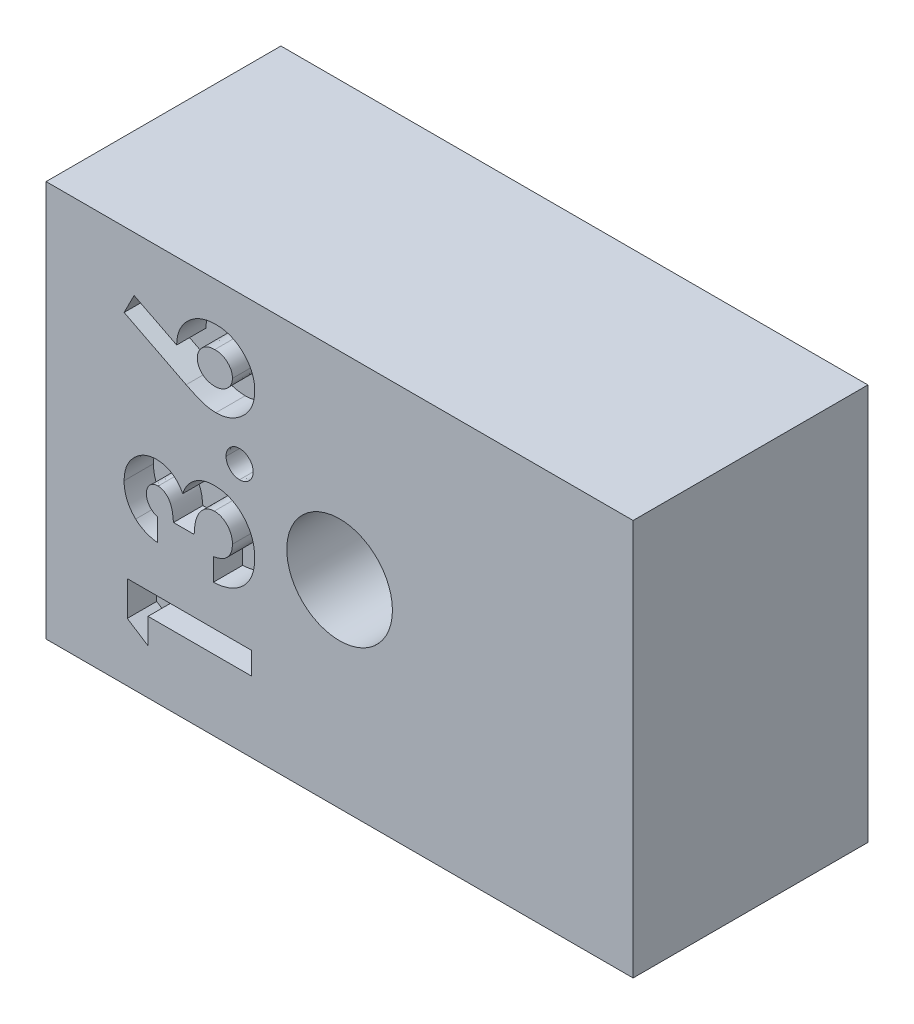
ISO-10303-21;
HEADER;
FILE_DESCRIPTION(('STEP AP214'),'2;1');
FILE_NAME('part.step','',(''),(''),'','','');
FILE_SCHEMA(('AUTOMOTIVE_DESIGN { 1 0 10303 214 1 1 1 1 }'));
ENDSEC;
DATA;
#1=APPLICATION_CONTEXT('core data for automotive mechanical design processes');
#2=APPLICATION_PROTOCOL_DEFINITION('international standard','automotive_design',2000,#1);
#3=PRODUCT_CONTEXT('',#1,'mechanical');
#4=PRODUCT('Part','Part','',(#3));
#5=PRODUCT_RELATED_PRODUCT_CATEGORY('part','',(#4));
#6=PRODUCT_DEFINITION_FORMATION('','',#4);
#7=PRODUCT_DEFINITION_CONTEXT('part definition',#1,'design');
#8=PRODUCT_DEFINITION('design','',#6,#7);
#9=PRODUCT_DEFINITION_SHAPE('','',#8);
#10=(LENGTH_UNIT() NAMED_UNIT(*) SI_UNIT(.MILLI.,.METRE.));
#11=(NAMED_UNIT(*) PLANE_ANGLE_UNIT() SI_UNIT($,.RADIAN.));
#12=(NAMED_UNIT(*) SI_UNIT($,.STERADIAN.) SOLID_ANGLE_UNIT());
#13=UNCERTAINTY_MEASURE_WITH_UNIT(LENGTH_MEASURE(1.E-05),#10,'distance_accuracy_value','');
#14=(GEOMETRIC_REPRESENTATION_CONTEXT(3) GLOBAL_UNCERTAINTY_ASSIGNED_CONTEXT((#13)) GLOBAL_UNIT_ASSIGNED_CONTEXT((#10,
#11,#12)) REPRESENTATION_CONTEXT('',''));
#15=CARTESIAN_POINT('',(0.,0.,0.));
#16=DIRECTION('',(0.,0.,1.));
#17=DIRECTION('',(1.,0.,0.));
#18=AXIS2_PLACEMENT_3D('',#15,#16,#17);
#19=CARTESIAN_POINT('',(0.,0.,8.));
#20=DIRECTION('',(0.,0.,1.));
#21=DIRECTION('',(1.,0.,0.));
#22=AXIS2_PLACEMENT_3D('',#19,#20,#21);
#23=PLANE('',#22);
#24=DIRECTION('',(0.,-1.,0.));
#25=VECTOR('',#24,1.);
#26=CARTESIAN_POINT('',(-8.77319610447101,-4.5627966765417,8.));
#27=LINE('',#26,#25);
#28=CARTESIAN_POINT('',(-8.77319610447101,-4.5627966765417,8.));
#29=VERTEX_POINT('',#28);
#30=CARTESIAN_POINT('',(-8.77319610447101,-5.43117274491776,8.));
#31=VERTEX_POINT('',#30);
#32=EDGE_CURVE('E1015',#29,#31,#27,.T.);
#33=ORIENTED_EDGE('',*,*,#32,.T.);
#34=DIRECTION('',(-0.841112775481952,0.540859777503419,0.));
#35=VECTOR('',#34,1.);
#36=CARTESIAN_POINT('',(-8.77319610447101,-5.43117274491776,8.));
#37=LINE('',#36,#35);
#38=CARTESIAN_POINT('',(-9.47875166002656,-4.97748017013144,8.));
#39=VERTEX_POINT('',#38);
#40=EDGE_CURVE('E319',#31,#39,#37,.T.);
#41=ORIENTED_EDGE('',*,*,#40,.T.);
#42=DIRECTION('',(0.,1.,0.));
#43=VECTOR('',#42,1.);
#44=CARTESIAN_POINT('',(-9.47875166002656,-4.97748017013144,8.));
#45=LINE('',#44,#43);
#46=CARTESIAN_POINT('',(-9.47875166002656,-3.80296761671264,8.));
#47=VERTEX_POINT('',#46);
#48=EDGE_CURVE('E323',#39,#47,#45,.T.);
#49=ORIENTED_EDGE('',*,*,#48,.T.);
#50=DIRECTION('',(1.,0.,0.));
#51=VECTOR('',#50,1.);
#52=CARTESIAN_POINT('',(-9.47875166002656,-3.80296761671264,8.));
#53=LINE('',#52,#51);
#54=CARTESIAN_POINT('',(-5.24541832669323,-3.80296761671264,8.));
#55=VERTEX_POINT('',#54);
#56=EDGE_CURVE('E1028',#47,#55,#53,.T.);
#57=ORIENTED_EDGE('',*,*,#56,.T.);
#58=DIRECTION('',(0.,-1.,0.));
#59=VECTOR('',#58,1.);
#60=CARTESIAN_POINT('',(-5.24541832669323,-3.80296761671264,8.));
#61=LINE('',#60,#59);
#62=CARTESIAN_POINT('',(-5.24541832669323,-4.5627966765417,8.));
#63=VERTEX_POINT('',#62);
#64=EDGE_CURVE('E1031',#55,#63,#61,.T.);
#65=ORIENTED_EDGE('',*,*,#64,.T.);
#66=DIRECTION('',(-1.,0.,0.));
#67=VECTOR('',#66,1.);
#68=CARTESIAN_POINT('',(-5.24541832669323,-4.5627966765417,8.));
#69=LINE('',#68,#67);
#70=EDGE_CURVE('E1034',#63,#29,#69,.T.);
#71=ORIENTED_EDGE('',*,*,#70,.T.);
#72=EDGE_LOOP('',(#33,#41,#49,#57,#65,#71));
#73=FACE_BOUND('',#72,.T.);
#74=CARTESIAN_POINT('',(-2.24541832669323,-0.220916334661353,8.));
#75=DIRECTION('',(0.,0.,1.));
#76=DIRECTION('',(1.,0.,0.));
#77=AXIS2_PLACEMENT_3D('',#74,#75,#76);
#78=CIRCLE('',#77,1.8);
#79=CARTESIAN_POINT('',(-0.445418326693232,-0.220916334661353,8.));
#80=VERTEX_POINT('',#79);
#81=EDGE_CURVE('E549',#80,#80,#78,.T.);
#82=ORIENTED_EDGE('',*,*,#81,.F.);
#83=EDGE_LOOP('',(#82));
#84=FACE_BOUND('',#83,.T.);
#85=DIRECTION('',(0.,-1.,0.));
#86=VECTOR('',#85,1.);
#87=CARTESIAN_POINT('',(-12.2454183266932,6.52908366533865,8.));
#88=LINE('',#87,#86);
#89=CARTESIAN_POINT('',(-12.2454183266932,6.52908366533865,8.));
#90=VERTEX_POINT('',#89);
#91=CARTESIAN_POINT('',(-12.2454183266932,-6.97091633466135,8.));
#92=VERTEX_POINT('',#91);
#93=EDGE_CURVE('E532',#90,#92,#88,.T.);
#94=ORIENTED_EDGE('',*,*,#93,.T.);
#95=DIRECTION('',(1.,0.,0.));
#96=VECTOR('',#95,1.);
#97=CARTESIAN_POINT('',(-12.2454183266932,-6.97091633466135,8.));
#98=LINE('',#97,#96);
#99=CARTESIAN_POINT('',(7.75458167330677,-6.97091633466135,8.));
#100=VERTEX_POINT('',#99);
#101=EDGE_CURVE('E546',#92,#100,#98,.T.);
#102=ORIENTED_EDGE('',*,*,#101,.T.);
#103=DIRECTION('',(0.,1.,0.));
#104=VECTOR('',#103,1.);
#105=CARTESIAN_POINT('',(7.75458167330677,6.52908366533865,8.));
#106=LINE('',#105,#104);
#107=CARTESIAN_POINT('',(7.75458167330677,6.52908366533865,8.));
#108=VERTEX_POINT('',#107);
#109=EDGE_CURVE('E526',#100,#108,#106,.T.);
#110=ORIENTED_EDGE('',*,*,#109,.T.);
#111=DIRECTION('',(-1.,0.,0.));
#112=VECTOR('',#111,1.);
#113=CARTESIAN_POINT('',(-12.2454183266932,6.52908366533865,8.));
#114=LINE('',#113,#112);
#115=EDGE_CURVE('E539',#108,#90,#114,.T.);
#116=ORIENTED_EDGE('',*,*,#115,.T.);
#117=EDGE_LOOP('',(#94,#102,#110,#116));
#118=FACE_BOUND('',#117,.T.);
#119=CARTESIAN_POINT('',(-6.46063600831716,2.60130588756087,8.));
#120=CARTESIAN_POINT('',(-6.49374122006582,2.60188790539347,8.));
#121=CARTESIAN_POINT('',(-6.5601359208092,2.60305518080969,8.));
#122=CARTESIAN_POINT('',(-6.65955821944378,2.61478633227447,8.));
#123=CARTESIAN_POINT('',(-6.75924213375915,2.63262011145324,8.));
#124=CARTESIAN_POINT('',(-6.84335649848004,2.65329713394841,8.));
#125=CARTESIAN_POINT('',(-6.91448912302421,2.67457530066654,8.));
#126=CARTESIAN_POINT('',(-6.97466947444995,2.69603451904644,8.));
#127=CARTESIAN_POINT('',(-7.04129273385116,2.72234000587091,8.));
#128=CARTESIAN_POINT('',(-7.11460086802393,2.75334036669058,8.));
#129=CARTESIAN_POINT('',(-7.19517138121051,2.78774990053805,8.));
#130=CARTESIAN_POINT('',(-7.28205941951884,2.82775037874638,8.));
#131=CARTESIAN_POINT('',(-7.37595801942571,2.87203915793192,8.));
#132=CARTESIAN_POINT('',(-7.44042941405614,2.90367694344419,8.));
#133=CARTESIAN_POINT('',(-7.474024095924,2.92016272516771,8.));
#134=B_SPLINE_CURVE_WITH_KNOTS('',3,(#119,#120,#121,#122,#123,#124,#125,#126,#127,#128,#129,
#130,#131,#132,#133),.UNSPECIFIED.,.F.,.F.,(4,1,1,1,1,1,1,1,1,1,1,1,4),(0.,0.0925382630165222,
0.185591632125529,0.279553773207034,0.375604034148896,0.427618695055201,0.487119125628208,
0.554201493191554,0.627897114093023,0.709686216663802,0.799179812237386,0.895356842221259,1.),.UNSPECIFIED.);
#135=CARTESIAN_POINT('',(-6.46063600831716,2.60130588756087,8.));
#136=VERTEX_POINT('',#135);
#137=CARTESIAN_POINT('',(-7.474024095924,2.92016272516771,8.));
#138=VERTEX_POINT('',#137);
#139=EDGE_CURVE('E422',#136,#138,#134,.T.);
#140=ORIENTED_EDGE('',*,*,#139,.T.);
#141=DIRECTION('',(-0.891257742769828,0.45349711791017,0.));
#142=VECTOR('',#141,1.);
#143=CARTESIAN_POINT('',(-7.474024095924,2.92016272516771,8.));
#144=LINE('',#143,#142);
#145=CARTESIAN_POINT('',(-9.58729866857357,3.99545652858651,8.));
#146=VERTEX_POINT('',#145);
#147=EDGE_CURVE('E411',#138,#146,#144,.T.);
#148=ORIENTED_EDGE('',*,*,#147,.T.);
#149=DIRECTION('',(0.452155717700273,0.891939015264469,0.));
#150=VECTOR('',#149,1.);
#151=CARTESIAN_POINT('',(-9.58729866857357,3.99545652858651,8.));
#152=LINE('',#151,#150);
#153=CARTESIAN_POINT('',(-9.24639321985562,4.6679391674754,8.));
#154=VERTEX_POINT('',#153);
#155=EDGE_CURVE('E962',#146,#154,#152,.T.);
#156=ORIENTED_EDGE('',*,*,#155,.T.);
#157=DIRECTION('',(0.891278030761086,-0.453457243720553,0.));
#158=VECTOR('',#157,1.);
#159=CARTESIAN_POINT('',(-9.24639321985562,4.6679391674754,8.));
#160=LINE('',#159,#158);
#161=CARTESIAN_POINT('',(-7.79627302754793,3.93015871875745,8.));
#162=VERTEX_POINT('',#161);
#163=EDGE_CURVE('E965',#154,#162,#160,.T.);
#164=ORIENTED_EDGE('',*,*,#163,.T.);
#165=CARTESIAN_POINT('',(-7.79627302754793,3.93015871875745,8.));
#166=CARTESIAN_POINT('',(-7.79515275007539,3.97374929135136,8.));
#167=CARTESIAN_POINT('',(-7.79294617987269,4.05960807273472,8.));
#168=CARTESIAN_POINT('',(-7.77486357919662,4.18587677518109,8.));
#169=CARTESIAN_POINT('',(-7.74421748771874,4.30689856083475,8.));
#170=CARTESIAN_POINT('',(-7.70144918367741,4.42266842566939,8.));
#171=CARTESIAN_POINT('',(-7.64771769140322,4.53401317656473,8.));
#172=CARTESIAN_POINT('',(-7.58159119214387,4.64039228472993,8.));
#173=CARTESIAN_POINT('',(-7.50150112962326,4.74038930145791,8.));
#174=CARTESIAN_POINT('',(-7.41260212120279,4.83586978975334,8.));
#175=CARTESIAN_POINT('',(-7.3141600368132,4.92270755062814,8.));
#176=CARTESIAN_POINT('',(-7.20836899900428,4.99813686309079,8.));
#177=CARTESIAN_POINT('',(-7.09781703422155,5.06387339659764,8.));
#178=CARTESIAN_POINT('',(-6.98002708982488,5.11497403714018,8.));
#179=CARTESIAN_POINT('',(-6.85695265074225,5.15619359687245,8.));
#180=CARTESIAN_POINT('',(-6.72810147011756,5.18593530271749,8.));
#181=CARTESIAN_POINT('',(-6.5931004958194,5.20290378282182,8.));
#182=CARTESIAN_POINT('',(-6.50138821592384,5.20524317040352,8.));
#183=CARTESIAN_POINT('',(-6.45469984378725,5.20643409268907,8.));
#184=B_SPLINE_CURVE_WITH_KNOTS('',3,(#165,#166,#167,#168,#169,#170,#171,#172,#173,#174,#175,
#176,#177,#178,#179,#180,#181,#182,#183),.UNSPECIFIED.,.F.,.F.,(4,1,1,1,1,1,1,1,1,1,1,1,1,1,1,1,
4),(0.,0.0633313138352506,0.124741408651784,0.184923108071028,0.244450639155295,
0.303797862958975,0.364327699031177,0.426050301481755,0.4897005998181,0.553738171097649,
0.616442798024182,0.678306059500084,0.740290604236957,0.802648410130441,0.866726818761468,
0.932154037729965,1.),.UNSPECIFIED.);
#185=CARTESIAN_POINT('',(-6.45469984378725,5.20643409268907,8.));
#186=VERTEX_POINT('',#185);
#187=EDGE_CURVE('E968',#162,#186,#184,.T.);
#188=ORIENTED_EDGE('',*,*,#187,.T.);
#189=CARTESIAN_POINT('',(-6.45469984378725,5.20643409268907,8.));
#190=CARTESIAN_POINT('',(-6.40969636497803,5.20531469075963,8.));
#191=CARTESIAN_POINT('',(-6.32074378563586,5.20310211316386,8.));
#192=CARTESIAN_POINT('',(-6.19007289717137,5.18491710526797,8.));
#193=CARTESIAN_POINT('',(-6.06452696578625,5.15520830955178,8.));
#194=CARTESIAN_POINT('',(-5.94447685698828,5.11370862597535,8.));
#195=CARTESIAN_POINT('',(-5.82993078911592,5.05949618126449,8.));
#196=CARTESIAN_POINT('',(-5.72026444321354,4.99433672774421,8.));
#197=CARTESIAN_POINT('',(-5.61632855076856,4.91634690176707,8.));
#198=CARTESIAN_POINT('',(-5.51876960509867,4.82795517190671,8.));
#199=CARTESIAN_POINT('',(-5.42985085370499,4.7313097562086,8.));
#200=CARTESIAN_POINT('',(-5.35081287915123,4.62944488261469,8.));
#201=CARTESIAN_POINT('',(-5.28552495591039,4.52149173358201,8.));
#202=CARTESIAN_POINT('',(-5.23038765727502,4.40949219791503,8.));
#203=CARTESIAN_POINT('',(-5.18924331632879,4.29138391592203,8.));
#204=CARTESIAN_POINT('',(-5.15818645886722,4.16893448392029,8.));
#205=CARTESIAN_POINT('',(-5.14026530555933,4.04121530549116,8.));
#206=CARTESIAN_POINT('',(-5.13801170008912,3.95452280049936,8.));
#207=CARTESIAN_POINT('',(-5.13687131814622,3.91065417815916,8.));
#208=B_SPLINE_CURVE_WITH_KNOTS('',3,(#189,#190,#191,#192,#193,#194,#195,#196,#197,#198,#199,
#200,#201,#202,#203,#204,#205,#206,#207),.UNSPECIFIED.,.F.,.F.,(4,1,1,1,1,1,1,1,1,1,1,1,1,1,1,1,
4),(0.,0.0656198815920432,0.129702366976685,0.192005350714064,0.253550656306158,
0.314600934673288,0.376542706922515,0.439295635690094,0.503806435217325,0.568290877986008,
0.630634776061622,0.69151775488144,0.752001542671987,0.812379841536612,0.87357890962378,
0.936027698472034,1.),.UNSPECIFIED.);
#209=CARTESIAN_POINT('',(-5.13687131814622,3.91065417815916,8.));
#210=VERTEX_POINT('',#209);
#211=EDGE_CURVE('E973',#186,#210,#208,.T.);
#212=ORIENTED_EDGE('',*,*,#211,.T.);
#213=CARTESIAN_POINT('',(-5.13687131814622,3.91065417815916,8.));
#214=CARTESIAN_POINT('',(-5.13781550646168,3.86478417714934,8.));
#215=CARTESIAN_POINT('',(-5.13967212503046,3.77458702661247,8.));
#216=CARTESIAN_POINT('',(-5.16015904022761,3.64255043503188,8.));
#217=CARTESIAN_POINT('',(-5.19159000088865,3.51622345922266,8.));
#218=CARTESIAN_POINT('',(-5.23427864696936,3.39509144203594,8.));
#219=CARTESIAN_POINT('',(-5.29221971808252,3.28066324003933,8.));
#220=CARTESIAN_POINT('',(-5.36164880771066,3.17196229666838,8.));
#221=CARTESIAN_POINT('',(-5.44416567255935,3.06942277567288,8.));
#222=CARTESIAN_POINT('',(-5.53729940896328,2.97371272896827,8.));
#223=CARTESIAN_POINT('',(-5.63935854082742,2.88750266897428,8.));
#224=CARTESIAN_POINT('',(-5.74531127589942,2.8106058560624,8.));
#225=CARTESIAN_POINT('',(-5.85533757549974,2.74555220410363,8.));
#226=CARTESIAN_POINT('',(-5.96931626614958,2.69289250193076,8.));
#227=CARTESIAN_POINT('',(-6.08688506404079,2.65180625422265,8.));
#228=CARTESIAN_POINT('',(-6.20826686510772,2.62321858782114,8.));
#229=CARTESIAN_POINT('',(-6.33313976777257,2.60459108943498,8.));
#230=CARTESIAN_POINT('',(-6.41788558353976,2.60240743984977,8.));
#231=CARTESIAN_POINT('',(-6.46063600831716,2.60130588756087,8.));
#232=B_SPLINE_CURVE_WITH_KNOTS('',3,(#213,#214,#215,#216,#217,#218,#219,#220,#221,#222,#223,
#224,#225,#226,#227,#228,#229,#230,#231),.UNSPECIFIED.,.F.,.F.,(4,1,1,1,1,1,1,1,1,1,1,1,1,1,1,1,
4),(0.,0.0664831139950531,0.130730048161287,0.193278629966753,0.25514079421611,0.31656663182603,
0.378893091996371,0.441900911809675,0.507138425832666,0.572289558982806,0.635442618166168,
0.696830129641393,0.757366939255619,0.817272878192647,0.877139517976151,0.938022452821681,1.),.UNSPECIFIED.);
#233=EDGE_CURVE('E981',#210,#136,#232,.T.);
#234=ORIENTED_EDGE('',*,*,#233,.T.);
#235=EDGE_LOOP('',(#140,#148,#156,#164,#188,#212,#234));
#236=FACE_BOUND('',#235,.T.);
#237=CARTESIAN_POINT('',(-5.19114482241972,1.48869904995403,8.));
#238=CARTESIAN_POINT('',(-5.19271969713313,1.45798934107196,8.));
#239=CARTESIAN_POINT('',(-5.19582442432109,1.39744784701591,8.));
#240=CARTESIAN_POINT('',(-5.22219326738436,1.31040062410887,8.));
#241=CARTESIAN_POINT('',(-5.26567140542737,1.23060600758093,8.));
#242=CARTESIAN_POINT('',(-5.32501096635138,1.16042508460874,8.));
#243=CARTESIAN_POINT('',(-5.39499946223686,1.10088971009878,8.));
#244=CARTESIAN_POINT('',(-5.47526895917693,1.05861350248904,8.));
#245=CARTESIAN_POINT('',(-5.56230766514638,1.03190906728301,8.));
#246=CARTESIAN_POINT('',(-5.62315952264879,1.02890496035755,8.));
#247=CARTESIAN_POINT('',(-5.65416565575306,1.02737426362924,8.));
#248=B_SPLINE_CURVE_WITH_KNOTS('',3,(#237,#238,#239,#240,#241,#242,#243,#244,#245,#246,#247),
.UNSPECIFIED.,.F.,.F.,(4,1,1,1,1,1,1,1,4),(0.,0.126667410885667,0.249713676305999,
0.371998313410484,0.499695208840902,0.62739210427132,0.749123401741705,0.872169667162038,1.),.UNSPECIFIED.);
#249=CARTESIAN_POINT('',(-5.19114482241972,1.48869904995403,8.));
#250=VERTEX_POINT('',#249);
#251=CARTESIAN_POINT('',(-5.65416565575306,1.02737426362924,8.));
#252=VERTEX_POINT('',#251);
#253=EDGE_CURVE('E336',#250,#252,#248,.T.);
#254=ORIENTED_EDGE('',*,*,#253,.T.);
#255=CARTESIAN_POINT('',(-5.65416565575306,1.02737426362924,8.));
#256=CARTESIAN_POINT('',(-5.68518374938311,1.02886752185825,8.));
#257=CARTESIAN_POINT('',(-5.74578754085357,1.03178508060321,8.));
#258=CARTESIAN_POINT('',(-5.8324107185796,1.05883932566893,8.));
#259=CARTESIAN_POINT('',(-5.91239536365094,1.10064380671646,8.));
#260=CARTESIAN_POINT('',(-5.98162647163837,1.1605021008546,8.));
#261=CARTESIAN_POINT('',(-6.04023809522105,1.23062342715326,8.));
#262=CARTESIAN_POINT('',(-6.08258879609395,1.3106288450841,8.));
#263=CARTESIAN_POINT('',(-6.10916580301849,1.39742219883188,8.));
#264=CARTESIAN_POINT('',(-6.11223668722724,1.45798070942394,8.));
#265=CARTESIAN_POINT('',(-6.1137943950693,1.48869904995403,8.));
#266=B_SPLINE_CURVE_WITH_KNOTS('',3,(#255,#256,#257,#258,#259,#260,#261,#262,#263,#264,#265),
.UNSPECIFIED.,.F.,.F.,(4,1,1,1,1,1,1,1,4),(0.,0.128255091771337,0.250587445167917,
0.372723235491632,0.499946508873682,0.627320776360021,0.749456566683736,0.872911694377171,1.),.UNSPECIFIED.);
#267=CARTESIAN_POINT('',(-6.1137943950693,1.48869904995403,8.));
#268=VERTEX_POINT('',#267);
#269=EDGE_CURVE('E56',#252,#268,#266,.T.);
#270=ORIENTED_EDGE('',*,*,#269,.T.);
#271=CARTESIAN_POINT('',(-6.1137943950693,1.48869904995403,8.));
#272=CARTESIAN_POINT('',(-6.11222387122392,1.51941029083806,8.));
#273=CARTESIAN_POINT('',(-6.10912772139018,1.57995480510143,8.));
#274=CARTESIAN_POINT('',(-6.08280855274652,1.66660962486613,8.));
#275=CARTESIAN_POINT('',(-6.03994669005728,1.74603746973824,8.00000000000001));
#276=CARTESIAN_POINT('',(-5.98169776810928,1.81613595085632,7.99999999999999));
#277=CARTESIAN_POINT('',(-5.91214489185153,1.87573131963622,8.));
#278=CARTESIAN_POINT('',(-5.83266632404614,1.91875012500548,8.));
#279=CARTESIAN_POINT('',(-5.74575414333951,1.94555189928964,8.));
#280=CARTESIAN_POINT('',(-5.68517244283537,1.94850988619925,8.));
#281=CARTESIAN_POINT('',(-5.65416565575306,1.95002383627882,8.));
#282=B_SPLINE_CURVE_WITH_KNOTS('',3,(#271,#272,#273,#274,#275,#276,#277,#278,#279,#280,#281),
.UNSPECIFIED.,.F.,.F.,(4,1,1,1,1,1,1,1,4),(0.,0.127149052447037,0.25066319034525,
0.371823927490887,0.499259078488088,0.626543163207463,0.749292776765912,0.871683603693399,1.),.UNSPECIFIED.);
#283=CARTESIAN_POINT('',(-5.65416565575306,1.95002383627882,8.));
#284=VERTEX_POINT('',#283);
#285=EDGE_CURVE('E892',#268,#284,#282,.T.);
#286=ORIENTED_EDGE('',*,*,#285,.T.);
#287=CARTESIAN_POINT('',(-5.65416565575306,1.95002383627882,8.));
#288=CARTESIAN_POINT('',(-5.62317082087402,1.94847246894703,8.));
#289=CARTESIAN_POINT('',(-5.56234113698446,1.94542779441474,8.));
#290=CARTESIAN_POINT('',(-5.47501196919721,1.91897863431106,8.));
#291=CARTESIAN_POINT('',(-5.39525139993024,1.87548298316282,8.));
#292=CARTESIAN_POINT('',(-5.32493879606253,1.81621418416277,8.));
#293=CARTESIAN_POINT('',(-5.26596518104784,1.74605050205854,8.));
#294=CARTESIAN_POINT('',(-5.22197313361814,1.66684078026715,8.));
#295=CARTESIAN_POINT('',(-5.19586279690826,1.57992862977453,8.));
#296=CARTESIAN_POINT('',(-5.19273261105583,1.51940148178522,8.));
#297=CARTESIAN_POINT('',(-5.19114482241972,1.48869904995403,8.));
#298=B_SPLINE_CURVE_WITH_KNOTS('',3,(#287,#288,#289,#290,#291,#292,#293,#294,#295,#296,#297),
.UNSPECIFIED.,.F.,.F.,(4,1,1,1,1,1,1,1,4),(0.,0.127890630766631,0.250994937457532,
0.37333725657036,0.501094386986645,0.62885151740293,0.750168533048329,0.87327283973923,1.),.UNSPECIFIED.);
#299=EDGE_CURVE('E901',#284,#250,#298,.T.);
#300=ORIENTED_EDGE('',*,*,#299,.T.);
#301=EDGE_LOOP('',(#254,#270,#286,#300));
#302=FACE_BOUND('',#301,.T.);
#303=CARTESIAN_POINT('',(-8.42889856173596,-0.54655736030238,8.));
#304=CARTESIAN_POINT('',(-8.4564656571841,-0.548017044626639,8.));
#305=CARTESIAN_POINT('',(-8.5102707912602,-0.550866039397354,8.));
#306=CARTESIAN_POINT('',(-8.58741460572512,-0.57342684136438,8.));
#307=CARTESIAN_POINT('',(-8.65654632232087,-0.611713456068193,8.));
#308=CARTESIAN_POINT('',(-8.71689267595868,-0.663662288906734,8.));
#309=CARTESIAN_POINT('',(-8.76611798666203,-0.727481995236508,8.));
#310=CARTESIAN_POINT('',(-8.80272894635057,-0.801341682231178,8.));
#311=CARTESIAN_POINT('',(-8.82408643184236,-0.884867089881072,8.));
#312=CARTESIAN_POINT('',(-8.82631634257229,-0.943590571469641,8.));
#313=CARTESIAN_POINT('',(-8.82746960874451,-0.973961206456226,8.));
#314=B_SPLINE_CURVE_WITH_KNOTS('',3,(#303,#304,#305,#306,#307,#308,#309,#310,#311,#312,#313),
.UNSPECIFIED.,.F.,.F.,(4,1,1,1,1,1,1,1,4),(0.,0.12616559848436,0.24624853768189,
0.364494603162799,0.485724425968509,0.608514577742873,0.731304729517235,0.861036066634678,1.),.UNSPECIFIED.);
#315=CARTESIAN_POINT('',(-8.42889856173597,-0.54655736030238,8.));
#316=VERTEX_POINT('',#315);
#317=CARTESIAN_POINT('',(-8.82746960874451,-0.973961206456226,8.));
#318=VERTEX_POINT('',#317);
#319=EDGE_CURVE('E314',#316,#318,#314,.T.);
#320=ORIENTED_EDGE('',*,*,#319,.T.);
#321=CARTESIAN_POINT('',(-8.82746960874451,-0.973961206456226,8.));
#322=CARTESIAN_POINT('',(-8.82611448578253,-1.0014920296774,8.));
#323=CARTESIAN_POINT('',(-8.8234255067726,-1.05612161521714,8.));
#324=CARTESIAN_POINT('',(-8.80335567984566,-1.13600642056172,8.));
#325=CARTESIAN_POINT('',(-8.76957062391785,-1.21187037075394,8.));
#326=CARTESIAN_POINT('',(-8.72298302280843,-1.28214253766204,8.));
#327=CARTESIAN_POINT('',(-8.66703328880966,-1.34580852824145,8.));
#328=CARTESIAN_POINT('',(-8.60077244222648,-1.39805993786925,8.));
#329=CARTESIAN_POINT('',(-8.52817028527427,-1.44152018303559,8.));
#330=CARTESIAN_POINT('',(-8.47453215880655,-1.45994183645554,8.));
#331=CARTESIAN_POINT('',(-8.44755507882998,-1.46920693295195,8.));
#332=B_SPLINE_CURVE_WITH_KNOTS('',3,(#321,#322,#323,#324,#325,#326,#327,#328,#329,#330,#331),
.UNSPECIFIED.,.F.,.F.,(4,1,1,1,1,1,1,1,4),(0.,0.123522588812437,0.245106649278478,
0.367265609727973,0.494690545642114,0.622323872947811,0.746002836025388,0.872253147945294,1.),.UNSPECIFIED.);
#333=CARTESIAN_POINT('',(-8.44755507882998,-1.46920693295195,8.));
#334=VERTEX_POINT('',#333);
#335=EDGE_CURVE('E48',#318,#334,#332,.T.);
#336=ORIENTED_EDGE('',*,*,#335,.T.);
#337=DIRECTION('',(0.,-1.,0.));
#338=VECTOR('',#337,1.);
#339=CARTESIAN_POINT('',(-8.44755507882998,-1.46920693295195,8.));
#340=LINE('',#339,#338);
#341=CARTESIAN_POINT('',(-8.44755507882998,-2.22903599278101,8.));
#342=VERTEX_POINT('',#341);
#343=EDGE_CURVE('E318',#334,#342,#340,.T.);
#344=ORIENTED_EDGE('',*,*,#343,.T.);
#345=CARTESIAN_POINT('',(-8.44755507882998,-2.22903599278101,8.));
#346=CARTESIAN_POINT('',(-8.48554453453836,-2.22370477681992,8.));
#347=CARTESIAN_POINT('',(-8.5597473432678,-2.21329159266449,8.));
#348=CARTESIAN_POINT('',(-8.66743150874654,-2.18769312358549,8.));
#349=CARTESIAN_POINT('',(-8.76983120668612,-2.15809004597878,8.));
#350=CARTESIAN_POINT('',(-8.86639688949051,-2.12023189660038,8.));
#351=CARTESIAN_POINT('',(-8.95702445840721,-2.07653149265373,8.));
#352=CARTESIAN_POINT('',(-9.04179501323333,-2.02557089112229,8.));
#353=CARTESIAN_POINT('',(-9.12192508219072,-1.96971469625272,8.));
#354=CARTESIAN_POINT('',(-9.16994455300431,-1.92598278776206,8.));
#355=CARTESIAN_POINT('',(-9.19381576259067,-1.90424299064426,8.));
#356=B_SPLINE_CURVE_WITH_KNOTS('',3,(#345,#346,#347,#348,#349,#350,#351,#352,#353,#354,#355),
.UNSPECIFIED.,.F.,.F.,(4,1,1,1,1,1,1,1,4),(0.,0.138943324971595,0.271390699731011,
0.400711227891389,0.524932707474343,0.646800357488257,0.764858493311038,0.883107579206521,1.),.UNSPECIFIED.);
#357=CARTESIAN_POINT('',(-9.19381576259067,-1.90424299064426,8.));
#358=VERTEX_POINT('',#357);
#359=EDGE_CURVE('E621',#342,#358,#356,.T.);
#360=ORIENTED_EDGE('',*,*,#359,.T.);
#361=CARTESIAN_POINT('',(-9.19381576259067,-1.90424299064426,8.));
#362=CARTESIAN_POINT('',(-9.22536078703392,-1.87296354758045,8.));
#363=CARTESIAN_POINT('',(-9.28753271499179,-1.81131505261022,8.));
#364=CARTESIAN_POINT('',(-9.36716808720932,-1.70829318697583,8.));
#365=CARTESIAN_POINT('',(-9.43608708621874,-1.60030724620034,8.));
#366=CARTESIAN_POINT('',(-9.49072656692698,-1.48519152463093,8.));
#367=CARTESIAN_POINT('',(-9.53495089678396,-1.36473730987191,8.));
#368=CARTESIAN_POINT('',(-9.56465647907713,-1.23798670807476,8.));
#369=CARTESIAN_POINT('',(-9.5843663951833,-1.10545766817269,8.));
#370=CARTESIAN_POINT('',(-9.58630789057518,-1.01502327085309,8.));
#371=CARTESIAN_POINT('',(-9.58729866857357,-0.968873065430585,8.));
#372=B_SPLINE_CURVE_WITH_KNOTS('',3,(#361,#362,#363,#364,#365,#366,#367,#368,#369,#370,#371),
.UNSPECIFIED.,.F.,.F.,(4,1,1,1,1,1,1,1,4),(0.,0.12740686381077,0.251105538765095,
0.372907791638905,0.494496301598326,0.616171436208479,0.740562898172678,0.86760485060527,1.),.UNSPECIFIED.);
#373=CARTESIAN_POINT('',(-9.58729866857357,-0.968873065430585,8.));
#374=VERTEX_POINT('',#373);
#375=EDGE_CURVE('E624',#358,#374,#372,.T.);
#376=ORIENTED_EDGE('',*,*,#375,.T.);
#377=CARTESIAN_POINT('',(-9.58729866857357,-0.968873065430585,8.));
#378=CARTESIAN_POINT('',(-9.58633003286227,-0.927843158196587,8.));
#379=CARTESIAN_POINT('',(-9.58442589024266,-0.847186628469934,8.));
#380=CARTESIAN_POINT('',(-9.56914046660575,-0.728641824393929,8.));
#381=CARTESIAN_POINT('',(-9.54233153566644,-0.615619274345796,8.));
#382=CARTESIAN_POINT('',(-9.5072794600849,-0.506924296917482,8.));
#383=CARTESIAN_POINT('',(-9.45958525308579,-0.404155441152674,8.));
#384=CARTESIAN_POINT('',(-9.40422243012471,-0.305044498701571,8.));
#385=CARTESIAN_POINT('',(-9.33631762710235,-0.212360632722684,8.));
#386=CARTESIAN_POINT('',(-9.25959203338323,-0.125886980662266,8.));
#387=CARTESIAN_POINT('',(-9.17660579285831,-0.0464444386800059,8.));
#388=CARTESIAN_POINT('',(-9.08790032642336,0.0223531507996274,8.));
#389=CARTESIAN_POINT('',(-8.99584516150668,0.0814996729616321,8.));
#390=CARTESIAN_POINT('',(-8.89967549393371,0.130228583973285,8.));
#391=CARTESIAN_POINT('',(-8.79922859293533,0.167694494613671,8.));
#392=CARTESIAN_POINT('',(-8.69508472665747,0.193696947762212,8.));
#393=CARTESIAN_POINT('',(-8.58747369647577,0.210716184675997,8.));
#394=CARTESIAN_POINT('',(-8.51433192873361,0.212411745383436,8.));
#395=CARTESIAN_POINT('',(-8.47723590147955,0.21327169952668,8.));
#396=B_SPLINE_CURVE_WITH_KNOTS('',3,(#377,#378,#379,#380,#381,#382,#383,#384,#385,#386,#387,
#388,#389,#390,#391,#392,#393,#394,#395),.UNSPECIFIED.,.F.,.F.,(4,1,1,1,1,1,1,1,1,1,1,1,1,1,1,1,
4),(0.,0.0682139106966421,0.13409480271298,0.198285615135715,0.26116018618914,0.323634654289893,
0.386366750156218,0.449642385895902,0.514244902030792,0.578413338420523,0.640374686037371,
0.700614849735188,0.760103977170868,0.819298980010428,0.878465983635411,0.938360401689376,1.),.UNSPECIFIED.);
#397=CARTESIAN_POINT('',(-8.47723590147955,0.21327169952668,8.));
#398=VERTEX_POINT('',#397);
#399=EDGE_CURVE('E629',#374,#398,#396,.T.);
#400=ORIENTED_EDGE('',*,*,#399,.T.);
#401=CARTESIAN_POINT('',(-8.47723590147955,0.21327169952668,8.));
#402=CARTESIAN_POINT('',(-8.43130371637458,0.211473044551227,8.));
#403=CARTESIAN_POINT('',(-8.34060036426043,0.207921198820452,8.));
#404=CARTESIAN_POINT('',(-8.20811046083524,0.179831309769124,8.));
#405=CARTESIAN_POINT('',(-8.08171419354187,0.134675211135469,8.));
#406=CARTESIAN_POINT('',(-7.9629091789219,0.0704699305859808,8.));
#407=CARTESIAN_POINT('',(-7.85181917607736,-0.0101578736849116,8.));
#408=CARTESIAN_POINT('',(-7.75232406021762,-0.10903259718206,8.));
#409=CARTESIAN_POINT('',(-7.66288297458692,-0.223395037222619,8.));
#410=CARTESIAN_POINT('',(-7.61481672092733,-0.309246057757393,8.));
#411=CARTESIAN_POINT('',(-7.59020331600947,-0.353208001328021,8.));
#412=B_SPLINE_CURVE_WITH_KNOTS('',3,(#401,#402,#403,#404,#405,#406,#407,#408,#409,#410,#411),
.UNSPECIFIED.,.F.,.F.,(4,1,1,1,1,1,1,1,4),(0.,0.124097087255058,0.245057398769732,
0.364484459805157,0.485868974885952,0.608926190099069,0.734308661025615,0.863946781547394,1.),.UNSPECIFIED.);
#413=CARTESIAN_POINT('',(-7.59020331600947,-0.353208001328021,8.));
#414=VERTEX_POINT('',#413);
#415=EDGE_CURVE('E648',#398,#414,#412,.T.);
#416=ORIENTED_EDGE('',*,*,#415,.T.);
#417=CARTESIAN_POINT('',(-7.59020331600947,-0.353208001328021,8.));
#418=CARTESIAN_POINT('',(-7.58029755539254,-0.323032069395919,8.));
#419=CARTESIAN_POINT('',(-7.56083318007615,-0.263737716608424,8.));
#420=CARTESIAN_POINT('',(-7.52247463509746,-0.179474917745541,8.));
#421=CARTESIAN_POINT('',(-7.48064417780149,-0.0992846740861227,8.));
#422=CARTESIAN_POINT('',(-7.43181159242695,-0.0250009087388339,8.));
#423=CARTESIAN_POINT('',(-7.37936158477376,0.0454134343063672,8.));
#424=CARTESIAN_POINT('',(-7.32047407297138,0.109730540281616,8.));
#425=CARTESIAN_POINT('',(-7.25666060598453,0.169615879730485,8.));
#426=CARTESIAN_POINT('',(-7.18724232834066,0.223587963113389,8.));
#427=CARTESIAN_POINT('',(-7.11337341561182,0.271841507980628,8.));
#428=CARTESIAN_POINT('',(-7.03638155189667,0.314366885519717,8.));
#429=CARTESIAN_POINT('',(-6.9559853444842,0.350053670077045,8.));
#430=CARTESIAN_POINT('',(-6.87277559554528,0.380005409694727,8.));
#431=CARTESIAN_POINT('',(-6.78593338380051,0.402857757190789,8.));
#432=CARTESIAN_POINT('',(-6.69575300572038,0.418935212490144,8.));
#433=CARTESIAN_POINT('',(-6.60245174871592,0.428231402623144,8.));
#434=CARTESIAN_POINT('',(-6.53923976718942,0.429648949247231,8.));
#435=CARTESIAN_POINT('',(-6.5072773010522,0.430365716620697,8.));
#436=B_SPLINE_CURVE_WITH_KNOTS('',3,(#417,#418,#419,#420,#421,#422,#423,#424,#425,#426,#427,
#428,#429,#430,#431,#432,#433,#434,#435),.UNSPECIFIED.,.F.,.F.,(4,1,1,1,1,1,1,1,1,1,1,1,1,1,1,1,
4),(0.,0.0662109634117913,0.130101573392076,0.192891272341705,0.254723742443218,
0.315349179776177,0.375885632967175,0.436387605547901,0.49773160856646,0.5590699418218,
0.620303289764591,0.681020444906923,0.742389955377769,0.804614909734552,0.868123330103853,
0.933317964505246,1.),.UNSPECIFIED.);
#437=CARTESIAN_POINT('',(-6.5072773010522,0.430365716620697,8.));
#438=VERTEX_POINT('',#437);
#439=EDGE_CURVE('E656',#414,#438,#436,.T.);
#440=ORIENTED_EDGE('',*,*,#439,.T.);
#441=CARTESIAN_POINT('',(-6.5072773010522,0.430365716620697,8.));
#442=CARTESIAN_POINT('',(-6.46030549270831,0.428912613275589,8.));
#443=CARTESIAN_POINT('',(-6.36768665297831,0.426047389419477,8.));
#444=CARTESIAN_POINT('',(-6.23126883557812,0.407831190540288,8.));
#445=CARTESIAN_POINT('',(-6.10120558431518,0.373917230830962,8.));
#446=CARTESIAN_POINT('',(-5.97600496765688,0.32929717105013,8.));
#447=CARTESIAN_POINT('',(-5.85726608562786,0.269795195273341,8.));
#448=CARTESIAN_POINT('',(-5.74232942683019,0.199711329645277,8.));
#449=CARTESIAN_POINT('',(-5.63509278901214,0.113926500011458,8.));
#450=CARTESIAN_POINT('',(-5.53349820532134,0.0177268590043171,8.));
#451=CARTESIAN_POINT('',(-5.44068238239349,-0.0885506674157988,8.));
#452=CARTESIAN_POINT('',(-5.3586785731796,-0.202912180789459,8.));
#453=CARTESIAN_POINT('',(-5.2910794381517,-0.325579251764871,8.));
#454=CARTESIAN_POINT('',(-5.23329991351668,-0.45358625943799,8.));
#455=CARTESIAN_POINT('',(-5.19041842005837,-0.589816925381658,8.));
#456=CARTESIAN_POINT('',(-5.15901571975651,-0.732509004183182,8.));
#457=CARTESIAN_POINT('',(-5.13990936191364,-0.882704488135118,8.));
#458=CARTESIAN_POINT('',(-5.13789835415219,-0.985211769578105,8.));
#459=CARTESIAN_POINT('',(-5.13687131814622,-1.03756296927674,8.));
#460=B_SPLINE_CURVE_WITH_KNOTS('',3,(#441,#442,#443,#444,#445,#446,#447,#448,#449,#450,#451,
#452,#453,#454,#455,#456,#457,#458,#459),.UNSPECIFIED.,.F.,.F.,(4,1,1,1,1,1,1,1,1,1,1,1,1,1,1,1,
4),(0.,0.0628267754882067,0.123881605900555,0.183570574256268,0.242287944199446,
0.301291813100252,0.360878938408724,0.421986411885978,0.484557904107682,0.547788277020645,
0.610411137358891,0.672354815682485,0.734805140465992,0.797929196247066,0.862961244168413,
0.9300133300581,1.),.UNSPECIFIED.);
#461=CARTESIAN_POINT('',(-5.13687131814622,-1.03756296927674,8.));
#462=VERTEX_POINT('',#461);
#463=EDGE_CURVE('E664',#438,#462,#460,.T.);
#464=ORIENTED_EDGE('',*,*,#463,.T.);
#465=CARTESIAN_POINT('',(-5.13687131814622,-1.03756296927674,8.));
#466=CARTESIAN_POINT('',(-5.13795167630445,-1.08708741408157,8.));
#467=CARTESIAN_POINT('',(-5.14006417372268,-1.18392591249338,8.));
#468=CARTESIAN_POINT('',(-5.1583489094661,-1.32557248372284,8.));
#469=CARTESIAN_POINT('',(-5.18784367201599,-1.46019414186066,8.));
#470=CARTESIAN_POINT('',(-5.22941898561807,-1.58813444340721,8.));
#471=CARTESIAN_POINT('',(-5.28333506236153,-1.70889839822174,8.00000000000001));
#472=CARTESIAN_POINT('',(-5.34753701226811,-1.82358114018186,8.));
#473=CARTESIAN_POINT('',(-5.42572785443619,-1.92989420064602,8.));
#474=CARTESIAN_POINT('',(-5.51437790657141,-2.02902211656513,8.));
#475=CARTESIAN_POINT('',(-5.61383823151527,-2.11876593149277,8.));
#476=CARTESIAN_POINT('',(-5.72180488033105,-2.1989757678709,8.));
#477=CARTESIAN_POINT('',(-5.83868840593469,-2.26788298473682,8.));
#478=CARTESIAN_POINT('',(-5.96398943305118,-2.32577017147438,8.));
#479=CARTESIAN_POINT('',(-6.09792777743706,-2.37218478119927,8.));
#480=CARTESIAN_POINT('',(-6.24023106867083,-2.40879648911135,8.));
#481=CARTESIAN_POINT('',(-6.39117732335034,-2.43437036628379,8.));
#482=CARTESIAN_POINT('',(-6.49503155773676,-2.44215894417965,8.));
#483=CARTESIAN_POINT('',(-6.54798242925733,-2.44613000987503,8.));
#484=B_SPLINE_CURVE_WITH_KNOTS('',3,(#465,#466,#467,#468,#469,#470,#471,#472,#473,#474,#475,
#476,#477,#478,#479,#480,#481,#482,#483),.UNSPECIFIED.,.F.,.F.,(4,1,1,1,1,1,1,1,1,1,1,1,1,1,1,1,
4),(0.,0.0666590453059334,0.130342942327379,0.191936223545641,0.251995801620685,
0.311121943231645,0.369754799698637,0.428602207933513,0.488435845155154,0.548524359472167,
0.608661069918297,0.669235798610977,0.730880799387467,0.794196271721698,0.859830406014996,
0.928533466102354,1.),.UNSPECIFIED.);
#485=CARTESIAN_POINT('',(-6.54798242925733,-2.44613000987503,8.));
#486=VERTEX_POINT('',#485);
#487=EDGE_CURVE('E672',#462,#486,#484,.T.);
#488=ORIENTED_EDGE('',*,*,#487,.T.);
#489=DIRECTION('',(0.,1.,0.));
#490=VECTOR('',#489,1.);
#491=CARTESIAN_POINT('',(-6.54798242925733,-2.44613000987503,8.));
#492=LINE('',#491,#490);
#493=CARTESIAN_POINT('',(-6.54798242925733,-1.68630095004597,8.));
#494=VERTEX_POINT('',#493);
#495=EDGE_CURVE('E680',#486,#494,#492,.T.);
#496=ORIENTED_EDGE('',*,*,#495,.T.);
#497=CARTESIAN_POINT('',(-6.54798242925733,-1.68630095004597,8.));
#498=CARTESIAN_POINT('',(-6.52135847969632,-1.68148505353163,8.));
#499=CARTESIAN_POINT('',(-6.46950135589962,-1.67210483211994,8.));
#500=CARTESIAN_POINT('',(-6.39441638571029,-1.6538258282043,8.));
#501=CARTESIAN_POINT('',(-6.32513559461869,-1.629943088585,8.));
#502=CARTESIAN_POINT('',(-6.26114999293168,-1.60263803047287,8.));
#503=CARTESIAN_POINT('',(-6.2018029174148,-1.57244908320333,8.));
#504=CARTESIAN_POINT('',(-6.14868141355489,-1.53637852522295,8.));
#505=CARTESIAN_POINT('',(-6.09969780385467,-1.49770288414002,8.));
#506=CARTESIAN_POINT('',(-6.04339444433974,-1.43956458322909,8.));
#507=CARTESIAN_POINT('',(-5.98434846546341,-1.3584483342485,8.));
#508=CARTESIAN_POINT('',(-5.93205464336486,-1.24862170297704,8.));
#509=CARTESIAN_POINT('',(-5.90231317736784,-1.1258926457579,8.));
#510=CARTESIAN_POINT('',(-5.89861291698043,-1.04026687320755,8.));
#511=CARTESIAN_POINT('',(-5.89670037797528,-0.996009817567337,8.));
#512=B_SPLINE_CURVE_WITH_KNOTS('',3,(#497,#498,#499,#500,#501,#502,#503,#504,#505,#506,#507,
#508,#509,#510,#511),.UNSPECIFIED.,.F.,.F.,(4,1,1,1,1,1,1,1,1,1,1,1,4),(0.,0.0773708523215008,
0.150700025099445,0.220747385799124,0.286665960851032,0.349581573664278,0.410791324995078,
0.47000397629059,0.527741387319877,0.641738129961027,0.755286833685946,0.873516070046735,1.),.UNSPECIFIED.);
#513=CARTESIAN_POINT('',(-5.89670037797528,-0.996009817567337,8.));
#514=VERTEX_POINT('',#513);
#515=EDGE_CURVE('E686',#494,#514,#512,.T.);
#516=ORIENTED_EDGE('',*,*,#515,.T.);
#517=CARTESIAN_POINT('',(-5.89670037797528,-0.996009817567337,8.));
#518=CARTESIAN_POINT('',(-5.89710539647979,-0.972522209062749,8.));
#519=CARTESIAN_POINT('',(-5.8978987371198,-0.926515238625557,8.));
#520=CARTESIAN_POINT('',(-5.90661202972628,-0.858920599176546,8.));
#521=CARTESIAN_POINT('',(-5.92112949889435,-0.794593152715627,8.));
#522=CARTESIAN_POINT('',(-5.94032350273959,-0.732998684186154,8.));
#523=CARTESIAN_POINT('',(-5.96636966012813,-0.675105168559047,8.));
#524=CARTESIAN_POINT('',(-5.99659613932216,-0.619601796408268,8.));
#525=CARTESIAN_POINT('',(-6.03359792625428,-0.567503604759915,8.));
#526=CARTESIAN_POINT('',(-6.07575795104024,-0.519114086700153,8.));
#527=CARTESIAN_POINT('',(-6.12077709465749,-0.474079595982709,8.));
#528=CARTESIAN_POINT('',(-6.17003983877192,-0.435625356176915,8.));
#529=CARTESIAN_POINT('',(-6.22118075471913,-0.402425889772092,8.));
#530=CARTESIAN_POINT('',(-6.27555253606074,-0.37622927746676,8.));
#531=CARTESIAN_POINT('',(-6.33143876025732,-0.354304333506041,8.));
#532=CARTESIAN_POINT('',(-6.39061573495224,-0.340630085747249,8.));
#533=CARTESIAN_POINT('',(-6.45179893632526,-0.330367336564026,8.));
#534=CARTESIAN_POINT('',(-6.49366275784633,-0.329767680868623,8.));
#535=CARTESIAN_POINT('',(-6.51490951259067,-0.329463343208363,8.));
#536=B_SPLINE_CURVE_WITH_KNOTS('',3,(#517,#518,#519,#520,#521,#522,#523,#524,#525,#526,#527,
#528,#529,#530,#531,#532,#533,#534,#535),.UNSPECIFIED.,.F.,.F.,(4,1,1,1,1,1,1,1,1,1,1,1,1,1,1,1,
4),(0.,0.0694189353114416,0.135976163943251,0.201068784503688,0.264244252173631,
0.32636593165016,0.388470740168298,0.450850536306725,0.514855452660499,0.578097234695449,
0.63879691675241,0.699312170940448,0.757998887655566,0.816988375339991,0.876385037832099,
0.937262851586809,1.),.UNSPECIFIED.);
#537=CARTESIAN_POINT('',(-6.51490951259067,-0.329463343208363,8.));
#538=VERTEX_POINT('',#537);
#539=EDGE_CURVE('E691',#514,#538,#536,.T.);
#540=ORIENTED_EDGE('',*,*,#539,.T.);
#541=CARTESIAN_POINT('',(-6.51490951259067,-0.329463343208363,8.));
#542=CARTESIAN_POINT('',(-6.53815401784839,-0.330237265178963,8.));
#543=CARTESIAN_POINT('',(-6.58415046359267,-0.331768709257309,8.));
#544=CARTESIAN_POINT('',(-6.65155605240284,-0.345245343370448,8.));
#545=CARTESIAN_POINT('',(-6.71664588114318,-0.365417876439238,8.));
#546=CARTESIAN_POINT('',(-6.77888290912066,-0.394429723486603,8.));
#547=CARTESIAN_POINT('',(-6.83790111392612,-0.432393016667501,8.));
#548=CARTESIAN_POINT('',(-6.89418928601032,-0.478552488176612,8.));
#549=CARTESIAN_POINT('',(-6.94729927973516,-0.533325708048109,8.));
#550=CARTESIAN_POINT('',(-6.99877787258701,-0.594878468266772,8.));
#551=CARTESIAN_POINT('',(-7.0438419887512,-0.665694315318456,8.));
#552=CARTESIAN_POINT('',(-7.08533930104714,-0.742913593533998,8.));
#553=CARTESIAN_POINT('',(-7.11838138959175,-0.828438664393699,8.));
#554=CARTESIAN_POINT('',(-7.14788688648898,-0.920217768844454,8.));
#555=CARTESIAN_POINT('',(-7.1694390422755,-1.01997657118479,8.));
#556=CARTESIAN_POINT('',(-7.18508748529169,-1.12709861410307,8.));
#557=CARTESIAN_POINT('',(-7.19673548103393,-1.24141021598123,8.));
#558=CARTESIAN_POINT('',(-7.1984065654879,-1.32020672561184,8.));
#559=CARTESIAN_POINT('',(-7.19926448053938,-1.36065992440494,8.));
#560=B_SPLINE_CURVE_WITH_KNOTS('',3,(#541,#542,#543,#544,#545,#546,#547,#548,#549,#550,#551,
#552,#553,#554,#555,#556,#557,#558,#559),.UNSPECIFIED.,.F.,.F.,(4,1,1,1,1,1,1,1,1,1,1,1,1,1,1,1,
4),(0.,0.050616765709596,0.100160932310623,0.149266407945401,0.198883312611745,
0.249304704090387,0.301846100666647,0.357178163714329,0.415398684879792,0.476408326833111,
0.539798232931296,0.606157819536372,0.675919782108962,0.749765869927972,0.828276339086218,
0.911839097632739,1.),.UNSPECIFIED.);
#561=CARTESIAN_POINT('',(-7.19926448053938,-1.36065992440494,8.));
#562=VERTEX_POINT('',#561);
#563=EDGE_CURVE('E699',#538,#562,#560,.T.);
#564=ORIENTED_EDGE('',*,*,#563,.T.);
#565=DIRECTION('',(-1.,0.,0.));
#566=VECTOR('',#565,1.);
#567=CARTESIAN_POINT('',(-7.19926448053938,-1.36065992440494,8.));
#568=LINE('',#567,#566);
#569=CARTESIAN_POINT('',(-7.90482003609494,-1.36065992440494,8.));
#570=VERTEX_POINT('',#569);
#571=EDGE_CURVE('E579',#562,#570,#568,.T.);
#572=ORIENTED_EDGE('',*,*,#571,.T.);
#573=CARTESIAN_POINT('',(-7.90482003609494,-1.36065992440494,8.));
#574=CARTESIAN_POINT('',(-7.90909339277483,-1.31028714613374,8.));
#575=CARTESIAN_POINT('',(-7.91708799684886,-1.21604965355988,8.));
#576=CARTESIAN_POINT('',(-7.93604682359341,-1.08533292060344,8.));
#577=CARTESIAN_POINT('',(-7.96057238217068,-0.974911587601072,8.));
#578=CARTESIAN_POINT('',(-7.99253583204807,-0.883523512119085,8.));
#579=CARTESIAN_POINT('',(-8.0298714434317,-0.806384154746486,8.));
#580=CARTESIAN_POINT('',(-8.07313101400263,-0.739941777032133,8.));
#581=CARTESIAN_POINT('',(-8.12280653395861,-0.681972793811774,8.));
#582=CARTESIAN_POINT('',(-8.17882562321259,-0.634290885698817,8.));
#583=CARTESIAN_POINT('',(-8.23754505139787,-0.59455503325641,8.));
#584=CARTESIAN_POINT('',(-8.29999622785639,-0.567353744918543,8.));
#585=CARTESIAN_POINT('',(-8.3636944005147,-0.549121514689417,8.));
#586=CARTESIAN_POINT('',(-8.40729461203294,-0.547406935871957,8.));
#587=CARTESIAN_POINT('',(-8.42889856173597,-0.54655736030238,8.));
#588=B_SPLINE_CURVE_WITH_KNOTS('',3,(#573,#574,#575,#576,#577,#578,#579,#580,#581,#582,#583,
#584,#585,#586,#587),.UNSPECIFIED.,.F.,.F.,(4,1,1,1,1,1,1,1,1,1,1,1,4),(0.,0.141725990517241,
0.265141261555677,0.370116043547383,0.458355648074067,0.535986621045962,0.609852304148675,
0.680090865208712,0.749211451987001,0.815601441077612,0.878051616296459,0.939574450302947,1.),.UNSPECIFIED.);
#589=EDGE_CURVE('E575',#570,#316,#588,.T.);
#590=ORIENTED_EDGE('',*,*,#589,.T.);
#591=EDGE_LOOP('',(#320,#336,#344,#360,#376,#400,#416,#440,#464,#488,#496,#516,#540,#564,#572,#590));
#592=FACE_BOUND('',#591,.T.);
#593=ADVANCED_FACE('F33',(#73,#84,#118,#236,#302,#592),#23,.T.);
#594=CARTESIAN_POINT('',(0.,0.,0.));
#595=DIRECTION('',(0.,0.,1.));
#596=DIRECTION('',(1.,0.,0.));
#597=AXIS2_PLACEMENT_3D('',#594,#595,#596);
#598=PLANE('',#597);
#599=DIRECTION('',(0.,-1.,0.));
#600=VECTOR('',#599,1.);
#601=CARTESIAN_POINT('',(-12.2454183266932,6.52908366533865,0.));
#602=LINE('',#601,#600);
#603=CARTESIAN_POINT('',(-12.2454183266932,6.52908366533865,0.));
#604=VERTEX_POINT('',#603);
#605=CARTESIAN_POINT('',(-12.2454183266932,-6.97091633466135,0.));
#606=VERTEX_POINT('',#605);
#607=EDGE_CURVE('E522',#604,#606,#602,.T.);
#608=ORIENTED_EDGE('',*,*,#607,.F.);
#609=DIRECTION('',(-1.,0.,0.));
#610=VECTOR('',#609,1.);
#611=CARTESIAN_POINT('',(-12.2454183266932,6.52908366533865,0.));
#612=LINE('',#611,#610);
#613=CARTESIAN_POINT('',(7.75458167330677,6.52908366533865,0.));
#614=VERTEX_POINT('',#613);
#615=EDGE_CURVE('E530',#614,#604,#612,.T.);
#616=ORIENTED_EDGE('',*,*,#615,.F.);
#617=DIRECTION('',(0.,1.,0.));
#618=VECTOR('',#617,1.);
#619=CARTESIAN_POINT('',(7.75458167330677,6.52908366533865,0.));
#620=LINE('',#619,#618);
#621=CARTESIAN_POINT('',(7.75458167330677,-6.97091633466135,0.));
#622=VERTEX_POINT('',#621);
#623=EDGE_CURVE('E521',#622,#614,#620,.T.);
#624=ORIENTED_EDGE('',*,*,#623,.F.);
#625=DIRECTION('',(1.,0.,0.));
#626=VECTOR('',#625,1.);
#627=CARTESIAN_POINT('',(-12.2454183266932,-6.97091633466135,0.));
#628=LINE('',#627,#626);
#629=EDGE_CURVE('E514',#606,#622,#628,.T.);
#630=ORIENTED_EDGE('',*,*,#629,.F.);
#631=EDGE_LOOP('',(#608,#616,#624,#630));
#632=FACE_BOUND('',#631,.T.);
#633=CARTESIAN_POINT('',(-2.24541832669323,-0.220916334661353,0.));
#634=DIRECTION('',(0.,0.,1.));
#635=DIRECTION('',(1.,0.,0.));
#636=AXIS2_PLACEMENT_3D('',#633,#634,#635);
#637=CIRCLE('',#636,1.8);
#638=CARTESIAN_POINT('',(-0.445418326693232,-0.220916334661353,0.));
#639=VERTEX_POINT('',#638);
#640=EDGE_CURVE('E551',#639,#639,#637,.T.);
#641=ORIENTED_EDGE('',*,*,#640,.T.);
#642=EDGE_LOOP('',(#641));
#643=FACE_BOUND('',#642,.T.);
#644=ADVANCED_FACE('F494',(#632,#643),#598,.F.);
#645=CARTESIAN_POINT('',(-12.2454183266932,6.52908366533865,8.));
#646=DIRECTION('',(1.,0.,0.));
#647=DIRECTION('',(0.,0.,-1.));
#648=AXIS2_PLACEMENT_3D('',#645,#646,#647);
#649=PLANE('',#648);
#650=ORIENTED_EDGE('',*,*,#607,.T.);
#651=DIRECTION('',(0.,0.,-1.));
#652=VECTOR('',#651,1.);
#653=CARTESIAN_POINT('',(-12.2454183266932,-6.97091633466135,8.));
#654=LINE('',#653,#652);
#655=EDGE_CURVE('E11',#92,#606,#654,.T.);
#656=ORIENTED_EDGE('',*,*,#655,.F.);
#657=ORIENTED_EDGE('',*,*,#93,.F.);
#658=DIRECTION('',(0.,0.,-1.));
#659=VECTOR('',#658,1.);
#660=CARTESIAN_POINT('',(-12.2454183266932,6.52908366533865,8.));
#661=LINE('',#660,#659);
#662=EDGE_CURVE('E536',#90,#604,#661,.T.);
#663=ORIENTED_EDGE('',*,*,#662,.T.);
#664=EDGE_LOOP('',(#650,#656,#657,#663));
#665=FACE_BOUND('',#664,.T.);
#666=ADVANCED_FACE('F35',(#665),#649,.F.);
#667=CARTESIAN_POINT('',(-12.2454183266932,-6.97091633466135,8.));
#668=DIRECTION('',(0.,1.,0.));
#669=DIRECTION('',(0.,0.,1.));
#670=AXIS2_PLACEMENT_3D('',#667,#668,#669);
#671=PLANE('',#670);
#672=ORIENTED_EDGE('',*,*,#629,.T.);
#673=DIRECTION('',(0.,0.,-1.));
#674=VECTOR('',#673,1.);
#675=CARTESIAN_POINT('',(7.75458167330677,-6.97091633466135,8.));
#676=LINE('',#675,#674);
#677=EDGE_CURVE('E41',#100,#622,#676,.T.);
#678=ORIENTED_EDGE('',*,*,#677,.F.);
#679=ORIENTED_EDGE('',*,*,#101,.F.);
#680=ORIENTED_EDGE('',*,*,#655,.T.);
#681=EDGE_LOOP('',(#672,#678,#679,#680));
#682=FACE_BOUND('',#681,.T.);
#683=ADVANCED_FACE('F505',(#682),#671,.F.);
#684=CARTESIAN_POINT('',(7.75458167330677,6.52908366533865,8.));
#685=DIRECTION('',(-1.,0.,0.));
#686=DIRECTION('',(0.,0.,1.));
#687=AXIS2_PLACEMENT_3D('',#684,#685,#686);
#688=PLANE('',#687);
#689=ORIENTED_EDGE('',*,*,#623,.T.);
#690=DIRECTION('',(0.,0.,-1.));
#691=VECTOR('',#690,1.);
#692=CARTESIAN_POINT('',(7.75458167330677,6.52908366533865,8.));
#693=LINE('',#692,#691);
#694=EDGE_CURVE('E527',#108,#614,#693,.T.);
#695=ORIENTED_EDGE('',*,*,#694,.F.);
#696=ORIENTED_EDGE('',*,*,#109,.F.);
#697=ORIENTED_EDGE('',*,*,#677,.T.);
#698=EDGE_LOOP('',(#689,#695,#696,#697));
#699=FACE_BOUND('',#698,.T.);
#700=ADVANCED_FACE('F502',(#699),#688,.F.);
#701=CARTESIAN_POINT('',(-12.2454183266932,6.52908366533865,8.));
#702=DIRECTION('',(0.,-1.,0.));
#703=DIRECTION('',(0.,0.,-1.));
#704=AXIS2_PLACEMENT_3D('',#701,#702,#703);
#705=PLANE('',#704);
#706=ORIENTED_EDGE('',*,*,#615,.T.);
#707=ORIENTED_EDGE('',*,*,#662,.F.);
#708=ORIENTED_EDGE('',*,*,#115,.F.);
#709=ORIENTED_EDGE('',*,*,#694,.T.);
#710=EDGE_LOOP('',(#706,#707,#708,#709));
#711=FACE_BOUND('',#710,.T.);
#712=ADVANCED_FACE('F490',(#711),#705,.F.);
#713=CARTESIAN_POINT('',(-2.24541832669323,-0.220916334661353,8.));
#714=DIRECTION('',(0.,0.,-1.));
#715=DIRECTION('',(-1.,0.,0.));
#716=AXIS2_PLACEMENT_3D('',#713,#714,#715);
#717=CYLINDRICAL_SURFACE('',#716,1.8);
#718=ORIENTED_EDGE('',*,*,#81,.T.);
#719=EDGE_LOOP('',(#718));
#720=FACE_BOUND('',#719,.T.);
#721=ORIENTED_EDGE('',*,*,#640,.F.);
#722=EDGE_LOOP('',(#721));
#723=FACE_BOUND('',#722,.T.);
#724=ADVANCED_FACE('F486',(#720,#723),#717,.F.);
#725=CARTESIAN_POINT('',(-8.77319610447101,-5.43117274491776,7.));
#726=DIRECTION('',(0.540859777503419,0.841112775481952,0.));
#727=DIRECTION('',(-0.841112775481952,0.540859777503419,0.));
#728=AXIS2_PLACEMENT_3D('',#725,#726,#727);
#729=PLANE('',#728);
#730=ORIENTED_EDGE('',*,*,#40,.F.);
#731=DIRECTION('',(0.,0.,1.));
#732=VECTOR('',#731,1.);
#733=CARTESIAN_POINT('',(-8.77319610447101,-5.43117274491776,7.));
#734=LINE('',#733,#732);
#735=CARTESIAN_POINT('',(-8.77319610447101,-5.43117274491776,7.));
#736=VERTEX_POINT('',#735);
#737=EDGE_CURVE('E1024',#736,#31,#734,.T.);
#738=ORIENTED_EDGE('',*,*,#737,.F.);
#739=DIRECTION('',(-0.841112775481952,0.540859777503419,0.));
#740=VECTOR('',#739,1.);
#741=CARTESIAN_POINT('',(-8.77319610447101,-5.43117274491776,7.));
#742=LINE('',#741,#740);
#743=CARTESIAN_POINT('',(-9.47875166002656,-4.97748017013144,7.));
#744=VERTEX_POINT('',#743);
#745=EDGE_CURVE('E1011',#736,#744,#742,.T.);
#746=ORIENTED_EDGE('',*,*,#745,.T.);
#747=DIRECTION('',(0.,0.,1.));
#748=VECTOR('',#747,1.);
#749=CARTESIAN_POINT('',(-9.47875166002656,-4.97748017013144,7.));
#750=LINE('',#749,#748);
#751=EDGE_CURVE('E555',#744,#39,#750,.T.);
#752=ORIENTED_EDGE('',*,*,#751,.T.);
#753=EDGE_LOOP('',(#730,#738,#746,#752));
#754=FACE_BOUND('',#753,.T.);
#755=ADVANCED_FACE('F482',(#754),#729,.T.);
#756=CARTESIAN_POINT('',(-9.47875166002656,-4.97748017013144,7.));
#757=DIRECTION('',(1.,0.,0.));
#758=DIRECTION('',(0.,0.,-1.));
#759=AXIS2_PLACEMENT_3D('',#756,#757,#758);
#760=PLANE('',#759);
#761=ORIENTED_EDGE('',*,*,#48,.F.);
#762=ORIENTED_EDGE('',*,*,#751,.F.);
#763=DIRECTION('',(0.,1.,0.));
#764=VECTOR('',#763,1.);
#765=CARTESIAN_POINT('',(-9.47875166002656,-4.97748017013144,7.));
#766=LINE('',#765,#764);
#767=CARTESIAN_POINT('',(-9.47875166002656,-3.80296761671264,7.));
#768=VERTEX_POINT('',#767);
#769=EDGE_CURVE('E1014',#744,#768,#766,.T.);
#770=ORIENTED_EDGE('',*,*,#769,.T.);
#771=DIRECTION('',(0.,0.,1.));
#772=VECTOR('',#771,1.);
#773=CARTESIAN_POINT('',(-9.47875166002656,-3.80296761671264,7.));
#774=LINE('',#773,#772);
#775=EDGE_CURVE('E1046',#768,#47,#774,.T.);
#776=ORIENTED_EDGE('',*,*,#775,.T.);
#777=EDGE_LOOP('',(#761,#762,#770,#776));
#778=FACE_BOUND('',#777,.T.);
#779=ADVANCED_FACE('F478',(#778),#760,.T.);
#780=CARTESIAN_POINT('',(-9.47875166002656,-3.80296761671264,7.));
#781=DIRECTION('',(0.,-1.,0.));
#782=DIRECTION('',(0.,0.,-1.));
#783=AXIS2_PLACEMENT_3D('',#780,#781,#782);
#784=PLANE('',#783);
#785=ORIENTED_EDGE('',*,*,#56,.F.);
#786=ORIENTED_EDGE('',*,*,#775,.F.);
#787=DIRECTION('',(1.,0.,0.));
#788=VECTOR('',#787,1.);
#789=CARTESIAN_POINT('',(-9.47875166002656,-3.80296761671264,7.));
#790=LINE('',#789,#788);
#791=CARTESIAN_POINT('',(-5.24541832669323,-3.80296761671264,7.));
#792=VERTEX_POINT('',#791);
#793=EDGE_CURVE('E1017',#768,#792,#790,.T.);
#794=ORIENTED_EDGE('',*,*,#793,.T.);
#795=DIRECTION('',(0.,0.,1.));
#796=VECTOR('',#795,1.);
#797=CARTESIAN_POINT('',(-5.24541832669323,-3.80296761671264,7.));
#798=LINE('',#797,#796);
#799=EDGE_CURVE('E1045',#792,#55,#798,.T.);
#800=ORIENTED_EDGE('',*,*,#799,.T.);
#801=EDGE_LOOP('',(#785,#786,#794,#800));
#802=FACE_BOUND('',#801,.T.);
#803=ADVANCED_FACE('F474',(#802),#784,.T.);
#804=CARTESIAN_POINT('',(-5.24541832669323,-3.80296761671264,7.));
#805=DIRECTION('',(-1.,0.,0.));
#806=DIRECTION('',(0.,0.,1.));
#807=AXIS2_PLACEMENT_3D('',#804,#805,#806);
#808=PLANE('',#807);
#809=ORIENTED_EDGE('',*,*,#64,.F.);
#810=ORIENTED_EDGE('',*,*,#799,.F.);
#811=DIRECTION('',(0.,-1.,0.));
#812=VECTOR('',#811,1.);
#813=CARTESIAN_POINT('',(-5.24541832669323,-3.80296761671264,7.));
#814=LINE('',#813,#812);
#815=CARTESIAN_POINT('',(-5.24541832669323,-4.5627966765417,7.));
#816=VERTEX_POINT('',#815);
#817=EDGE_CURVE('E1019',#792,#816,#814,.T.);
#818=ORIENTED_EDGE('',*,*,#817,.T.);
#819=DIRECTION('',(0.,0.,1.));
#820=VECTOR('',#819,1.);
#821=CARTESIAN_POINT('',(-5.24541832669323,-4.5627966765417,7.));
#822=LINE('',#821,#820);
#823=EDGE_CURVE('E1043',#816,#63,#822,.T.);
#824=ORIENTED_EDGE('',*,*,#823,.T.);
#825=EDGE_LOOP('',(#809,#810,#818,#824));
#826=FACE_BOUND('',#825,.T.);
#827=ADVANCED_FACE('F470',(#826),#808,.T.);
#828=CARTESIAN_POINT('',(-5.24541832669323,-4.5627966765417,7.));
#829=DIRECTION('',(0.,1.,0.));
#830=DIRECTION('',(0.,0.,1.));
#831=AXIS2_PLACEMENT_3D('',#828,#829,#830);
#832=PLANE('',#831);
#833=ORIENTED_EDGE('',*,*,#70,.F.);
#834=ORIENTED_EDGE('',*,*,#823,.F.);
#835=DIRECTION('',(-1.,0.,0.));
#836=VECTOR('',#835,1.);
#837=CARTESIAN_POINT('',(-5.24541832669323,-4.5627966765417,7.));
#838=LINE('',#837,#836);
#839=CARTESIAN_POINT('',(-8.77319610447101,-4.5627966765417,7.));
#840=VERTEX_POINT('',#839);
#841=EDGE_CURVE('E1021',#816,#840,#838,.T.);
#842=ORIENTED_EDGE('',*,*,#841,.T.);
#843=DIRECTION('',(0.,0.,1.));
#844=VECTOR('',#843,1.);
#845=CARTESIAN_POINT('',(-8.77319610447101,-4.5627966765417,7.));
#846=LINE('',#845,#844);
#847=EDGE_CURVE('E1041',#840,#29,#846,.T.);
#848=ORIENTED_EDGE('',*,*,#847,.T.);
#849=EDGE_LOOP('',(#833,#834,#842,#848));
#850=FACE_BOUND('',#849,.T.);
#851=ADVANCED_FACE('F466',(#850),#832,.T.);
#852=CARTESIAN_POINT('',(-8.77319610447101,-4.5627966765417,7.));
#853=DIRECTION('',(-1.,0.,0.));
#854=DIRECTION('',(0.,0.,1.));
#855=AXIS2_PLACEMENT_3D('',#852,#853,#854);
#856=PLANE('',#855);
#857=ORIENTED_EDGE('',*,*,#32,.F.);
#858=ORIENTED_EDGE('',*,*,#847,.F.);
#859=DIRECTION('',(0.,-1.,0.));
#860=VECTOR('',#859,1.);
#861=CARTESIAN_POINT('',(-8.77319610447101,-4.5627966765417,7.));
#862=LINE('',#861,#860);
#863=EDGE_CURVE('E1023',#840,#736,#862,.T.);
#864=ORIENTED_EDGE('',*,*,#863,.T.);
#865=ORIENTED_EDGE('',*,*,#737,.T.);
#866=EDGE_LOOP('',(#857,#858,#864,#865));
#867=FACE_BOUND('',#866,.T.);
#868=ADVANCED_FACE('F462',(#867),#856,.T.);
#869=CARTESIAN_POINT('',(0.,0.,7.));
#870=DIRECTION('',(0.,0.,-1.));
#871=DIRECTION('',(-1.,0.,0.));
#872=AXIS2_PLACEMENT_3D('',#869,#870,#871);
#873=PLANE('',#872);
#874=ORIENTED_EDGE('',*,*,#745,.F.);
#875=ORIENTED_EDGE('',*,*,#863,.F.);
#876=ORIENTED_EDGE('',*,*,#841,.F.);
#877=ORIENTED_EDGE('',*,*,#817,.F.);
#878=ORIENTED_EDGE('',*,*,#793,.F.);
#879=ORIENTED_EDGE('',*,*,#769,.F.);
#880=EDGE_LOOP('',(#874,#875,#876,#877,#878,#879));
#881=FACE_BOUND('',#880,.T.);
#882=ADVANCED_FACE('F458',(#881),#873,.F.);
#883=CARTESIAN_POINT('',(-7.474024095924,2.92016272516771,7.));
#884=DIRECTION('',(0.45349711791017,0.891257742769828,0.));
#885=DIRECTION('',(-0.891257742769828,0.45349711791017,0.));
#886=AXIS2_PLACEMENT_3D('',#883,#884,#885);
#887=PLANE('',#886);
#888=ORIENTED_EDGE('',*,*,#147,.F.);
#889=DIRECTION('',(0.,0.,1.));
#890=VECTOR('',#889,1.);
#891=CARTESIAN_POINT('',(-7.474024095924,2.92016272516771,7.));
#892=LINE('',#891,#890);
#893=CARTESIAN_POINT('',(-7.474024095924,2.92016272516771,7.));
#894=VERTEX_POINT('',#893);
#895=EDGE_CURVE('E953',#894,#138,#892,.T.);
#896=ORIENTED_EDGE('',*,*,#895,.F.);
#897=DIRECTION('',(-0.891257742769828,0.45349711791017,0.));
#898=VECTOR('',#897,1.);
#899=CARTESIAN_POINT('',(-7.474024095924,2.92016272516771,7.));
#900=LINE('',#899,#898);
#901=CARTESIAN_POINT('',(-9.58729866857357,3.99545652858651,7.));
#902=VERTEX_POINT('',#901);
#903=EDGE_CURVE('E418',#894,#902,#900,.T.);
#904=ORIENTED_EDGE('',*,*,#903,.T.);
#905=DIRECTION('',(0.,0.,1.));
#906=VECTOR('',#905,1.);
#907=CARTESIAN_POINT('',(-9.58729866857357,3.99545652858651,7.));
#908=LINE('',#907,#906);
#909=EDGE_CURVE('E893',#902,#146,#908,.T.);
#910=ORIENTED_EDGE('',*,*,#909,.T.);
#911=EDGE_LOOP('',(#888,#896,#904,#910));
#912=FACE_BOUND('',#911,.T.);
#913=ADVANCED_FACE('F454',(#912),#887,.T.);
#914=CARTESIAN_POINT('',(-9.58729866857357,3.99545652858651,7.));
#915=DIRECTION('',(0.891939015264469,-0.452155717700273,0.));
#916=DIRECTION('',(0.452155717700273,0.891939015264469,0.));
#917=AXIS2_PLACEMENT_3D('',#914,#915,#916);
#918=PLANE('',#917);
#919=ORIENTED_EDGE('',*,*,#155,.F.);
#920=ORIENTED_EDGE('',*,*,#909,.F.);
#921=DIRECTION('',(0.452155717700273,0.891939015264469,0.));
#922=VECTOR('',#921,1.);
#923=CARTESIAN_POINT('',(-9.58729866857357,3.99545652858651,7.));
#924=LINE('',#923,#922);
#925=CARTESIAN_POINT('',(-9.24639321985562,4.6679391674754,7.));
#926=VERTEX_POINT('',#925);
#927=EDGE_CURVE('E421',#902,#926,#924,.T.);
#928=ORIENTED_EDGE('',*,*,#927,.T.);
#929=DIRECTION('',(0.,0.,1.));
#930=VECTOR('',#929,1.);
#931=CARTESIAN_POINT('',(-9.24639321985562,4.6679391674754,7.));
#932=LINE('',#931,#930);
#933=EDGE_CURVE('E1007',#926,#154,#932,.T.);
#934=ORIENTED_EDGE('',*,*,#933,.T.);
#935=EDGE_LOOP('',(#919,#920,#928,#934));
#936=FACE_BOUND('',#935,.T.);
#937=ADVANCED_FACE('F450',(#936),#918,.T.);
#938=CARTESIAN_POINT('',(-9.24639321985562,4.6679391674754,7.));
#939=DIRECTION('',(-0.453457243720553,-0.891278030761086,0.));
#940=DIRECTION('',(0.891278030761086,-0.453457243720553,0.));
#941=AXIS2_PLACEMENT_3D('',#938,#939,#940);
#942=PLANE('',#941);
#943=ORIENTED_EDGE('',*,*,#163,.F.);
#944=ORIENTED_EDGE('',*,*,#933,.F.);
#945=DIRECTION('',(0.891278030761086,-0.453457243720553,0.));
#946=VECTOR('',#945,1.);
#947=CARTESIAN_POINT('',(-9.24639321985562,4.6679391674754,7.));
#948=LINE('',#947,#946);
#949=CARTESIAN_POINT('',(-7.79627302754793,3.93015871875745,7.));
#950=VERTEX_POINT('',#949);
#951=EDGE_CURVE('E424',#926,#950,#948,.T.);
#952=ORIENTED_EDGE('',*,*,#951,.T.);
#953=DIRECTION('',(0.,0.,1.));
#954=VECTOR('',#953,1.);
#955=CARTESIAN_POINT('',(-7.79627302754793,3.93015871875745,7.));
#956=LINE('',#955,#954);
#957=EDGE_CURVE('E1005',#950,#162,#956,.T.);
#958=ORIENTED_EDGE('',*,*,#957,.T.);
#959=EDGE_LOOP('',(#943,#944,#952,#958));
#960=FACE_BOUND('',#959,.T.);
#961=ADVANCED_FACE('F445',(#960),#942,.T.);
#962=CARTESIAN_POINT('',(-7.79627302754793,3.93015871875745,7.));
#963=CARTESIAN_POINT('',(-7.79515275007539,3.97374929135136,7.));
#964=CARTESIAN_POINT('',(-7.79294617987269,4.05960807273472,7.));
#965=CARTESIAN_POINT('',(-7.77486357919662,4.18587677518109,7.));
#966=CARTESIAN_POINT('',(-7.74421748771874,4.30689856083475,7.));
#967=CARTESIAN_POINT('',(-7.70144918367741,4.42266842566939,7.));
#968=CARTESIAN_POINT('',(-7.64771769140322,4.53401317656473,7.));
#969=CARTESIAN_POINT('',(-7.58159119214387,4.64039228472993,7.));
#970=CARTESIAN_POINT('',(-7.50150112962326,4.74038930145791,7.));
#971=CARTESIAN_POINT('',(-7.41260212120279,4.83586978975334,7.));
#972=CARTESIAN_POINT('',(-7.3141600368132,4.92270755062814,7.));
#973=CARTESIAN_POINT('',(-7.20836899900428,4.99813686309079,7.));
#974=CARTESIAN_POINT('',(-7.09781703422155,5.06387339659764,7.));
#975=CARTESIAN_POINT('',(-6.98002708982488,5.11497403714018,7.));
#976=CARTESIAN_POINT('',(-6.85695265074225,5.15619359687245,7.));
#977=CARTESIAN_POINT('',(-6.72810147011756,5.18593530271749,7.));
#978=CARTESIAN_POINT('',(-6.5931004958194,5.20290378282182,7.));
#979=CARTESIAN_POINT('',(-6.50138821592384,5.20524317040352,7.));
#980=CARTESIAN_POINT('',(-6.45469984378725,5.20643409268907,7.));
#981=B_SPLINE_CURVE_WITH_KNOTS('',3,(#962,#963,#964,#965,#966,#967,#968,#969,#970,#971,#972,
#973,#974,#975,#976,#977,#978,#979,#980),.UNSPECIFIED.,.F.,.F.,(4,1,1,1,1,1,1,1,1,1,1,1,1,1,1,1,
4),(0.,0.0633313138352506,0.124741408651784,0.184923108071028,0.244450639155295,
0.303797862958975,0.364327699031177,0.426050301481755,0.4897005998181,0.553738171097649,
0.616442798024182,0.678306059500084,0.740290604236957,0.802648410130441,0.866726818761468,
0.932154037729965,1.),.UNSPECIFIED.);
#982=DIRECTION('',(0.,0.,1.));
#983=VECTOR('',#982,1.);
#984=SURFACE_OF_LINEAR_EXTRUSION('',#981,#983);
#985=ORIENTED_EDGE('',*,*,#187,.F.);
#986=ORIENTED_EDGE('',*,*,#957,.F.);
#987=CARTESIAN_POINT('',(-6.45469984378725,5.20643409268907,7.));
#988=VERTEX_POINT('',#987);
#989=EDGE_CURVE('E426',#950,#988,#981,.T.);
#990=ORIENTED_EDGE('',*,*,#989,.T.);
#991=DIRECTION('',(0.,0.,1.));
#992=VECTOR('',#991,1.);
#993=CARTESIAN_POINT('',(-6.45469984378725,5.20643409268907,7.));
#994=LINE('',#993,#992);
#995=EDGE_CURVE('E1003',#988,#186,#994,.T.);
#996=ORIENTED_EDGE('',*,*,#995,.T.);
#997=EDGE_LOOP('',(#985,#986,#990,#996));
#998=FACE_BOUND('',#997,.T.);
#999=ADVANCED_FACE('F440',(#998),#984,.T.);
#1000=CARTESIAN_POINT('',(-6.45469984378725,5.20643409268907,7.));
#1001=CARTESIAN_POINT('',(-6.40969636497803,5.20531469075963,7.));
#1002=CARTESIAN_POINT('',(-6.32074378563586,5.20310211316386,7.));
#1003=CARTESIAN_POINT('',(-6.19007289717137,5.18491710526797,7.));
#1004=CARTESIAN_POINT('',(-6.06452696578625,5.15520830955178,7.));
#1005=CARTESIAN_POINT('',(-5.94447685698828,5.11370862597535,7.));
#1006=CARTESIAN_POINT('',(-5.82993078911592,5.05949618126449,7.));
#1007=CARTESIAN_POINT('',(-5.72026444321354,4.99433672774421,7.));
#1008=CARTESIAN_POINT('',(-5.61632855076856,4.91634690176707,7.));
#1009=CARTESIAN_POINT('',(-5.51876960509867,4.82795517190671,7.));
#1010=CARTESIAN_POINT('',(-5.42985085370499,4.7313097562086,7.));
#1011=CARTESIAN_POINT('',(-5.35081287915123,4.62944488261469,7.));
#1012=CARTESIAN_POINT('',(-5.28552495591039,4.52149173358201,7.));
#1013=CARTESIAN_POINT('',(-5.23038765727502,4.40949219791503,7.));
#1014=CARTESIAN_POINT('',(-5.18924331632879,4.29138391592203,7.));
#1015=CARTESIAN_POINT('',(-5.15818645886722,4.16893448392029,7.));
#1016=CARTESIAN_POINT('',(-5.14026530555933,4.04121530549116,7.));
#1017=CARTESIAN_POINT('',(-5.13801170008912,3.95452280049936,7.));
#1018=CARTESIAN_POINT('',(-5.13687131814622,3.91065417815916,7.));
#1019=B_SPLINE_CURVE_WITH_KNOTS('',3,(#1000,#1001,#1002,#1003,#1004,#1005,#1006,#1007,#1008,
#1009,#1010,#1011,#1012,#1013,#1014,#1015,#1016,#1017,#1018),.UNSPECIFIED.,.F.,.F.,(4,1,1,1,1,1,
1,1,1,1,1,1,1,1,1,1,4),(0.,0.0656198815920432,0.129702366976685,0.192005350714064,
0.253550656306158,0.314600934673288,0.376542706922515,0.439295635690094,0.503806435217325,
0.568290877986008,0.630634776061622,0.69151775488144,0.752001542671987,0.812379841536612,
0.87357890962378,0.936027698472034,1.),.UNSPECIFIED.);
#1020=DIRECTION('',(0.,0.,1.));
#1021=VECTOR('',#1020,1.);
#1022=SURFACE_OF_LINEAR_EXTRUSION('',#1019,#1021);
#1023=ORIENTED_EDGE('',*,*,#211,.F.);
#1024=ORIENTED_EDGE('',*,*,#995,.F.);
#1025=CARTESIAN_POINT('',(-5.13687131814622,3.91065417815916,7.));
#1026=VERTEX_POINT('',#1025);
#1027=EDGE_CURVE('E431',#988,#1026,#1019,.T.);
#1028=ORIENTED_EDGE('',*,*,#1027,.T.);
#1029=DIRECTION('',(0.,0.,1.));
#1030=VECTOR('',#1029,1.);
#1031=CARTESIAN_POINT('',(-5.13687131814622,3.91065417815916,7.));
#1032=LINE('',#1031,#1030);
#1033=EDGE_CURVE('E1001',#1026,#210,#1032,.T.);
#1034=ORIENTED_EDGE('',*,*,#1033,.T.);
#1035=EDGE_LOOP('',(#1023,#1024,#1028,#1034));
#1036=FACE_BOUND('',#1035,.T.);
#1037=ADVANCED_FACE('F444',(#1036),#1022,.T.);
#1038=CARTESIAN_POINT('',(-5.13687131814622,3.91065417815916,7.));
#1039=CARTESIAN_POINT('',(-5.13781550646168,3.86478417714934,7.));
#1040=CARTESIAN_POINT('',(-5.13967212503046,3.77458702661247,7.));
#1041=CARTESIAN_POINT('',(-5.16015904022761,3.64255043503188,7.));
#1042=CARTESIAN_POINT('',(-5.19159000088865,3.51622345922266,7.));
#1043=CARTESIAN_POINT('',(-5.23427864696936,3.39509144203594,7.));
#1044=CARTESIAN_POINT('',(-5.29221971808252,3.28066324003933,7.));
#1045=CARTESIAN_POINT('',(-5.36164880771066,3.17196229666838,7.));
#1046=CARTESIAN_POINT('',(-5.44416567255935,3.06942277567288,7.));
#1047=CARTESIAN_POINT('',(-5.53729940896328,2.97371272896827,7.));
#1048=CARTESIAN_POINT('',(-5.63935854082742,2.88750266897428,7.));
#1049=CARTESIAN_POINT('',(-5.74531127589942,2.8106058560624,7.));
#1050=CARTESIAN_POINT('',(-5.85533757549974,2.74555220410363,7.));
#1051=CARTESIAN_POINT('',(-5.96931626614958,2.69289250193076,7.));
#1052=CARTESIAN_POINT('',(-6.08688506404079,2.65180625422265,7.));
#1053=CARTESIAN_POINT('',(-6.20826686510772,2.62321858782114,7.));
#1054=CARTESIAN_POINT('',(-6.33313976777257,2.60459108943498,7.));
#1055=CARTESIAN_POINT('',(-6.41788558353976,2.60240743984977,7.));
#1056=CARTESIAN_POINT('',(-6.46063600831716,2.60130588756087,7.));
#1057=B_SPLINE_CURVE_WITH_KNOTS('',3,(#1038,#1039,#1040,#1041,#1042,#1043,#1044,#1045,#1046,
#1047,#1048,#1049,#1050,#1051,#1052,#1053,#1054,#1055,#1056),.UNSPECIFIED.,.F.,.F.,(4,1,1,1,1,1,
1,1,1,1,1,1,1,1,1,1,4),(0.,0.0664831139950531,0.130730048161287,0.193278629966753,
0.25514079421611,0.31656663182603,0.378893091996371,0.441900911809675,0.507138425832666,
0.572289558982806,0.635442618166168,0.696830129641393,0.757366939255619,0.817272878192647,
0.877139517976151,0.938022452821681,1.),.UNSPECIFIED.);
#1058=DIRECTION('',(0.,0.,1.));
#1059=VECTOR('',#1058,1.);
#1060=SURFACE_OF_LINEAR_EXTRUSION('',#1057,#1059);
#1061=ORIENTED_EDGE('',*,*,#233,.F.);
#1062=ORIENTED_EDGE('',*,*,#1033,.F.);
#1063=CARTESIAN_POINT('',(-6.46063600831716,2.60130588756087,7.));
#1064=VERTEX_POINT('',#1063);
#1065=EDGE_CURVE('E954',#1026,#1064,#1057,.T.);
#1066=ORIENTED_EDGE('',*,*,#1065,.T.);
#1067=DIRECTION('',(0.,0.,1.));
#1068=VECTOR('',#1067,1.);
#1069=CARTESIAN_POINT('',(-6.46063600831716,2.60130588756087,7.));
#1070=LINE('',#1069,#1068);
#1071=EDGE_CURVE('E999',#1064,#136,#1070,.T.);
#1072=ORIENTED_EDGE('',*,*,#1071,.T.);
#1073=EDGE_LOOP('',(#1061,#1062,#1066,#1072));
#1074=FACE_BOUND('',#1073,.T.);
#1075=ADVANCED_FACE('F946',(#1074),#1060,.T.);
#1076=CARTESIAN_POINT('',(-6.46063600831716,2.60130588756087,7.));
#1077=CARTESIAN_POINT('',(-6.49374122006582,2.60188790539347,7.));
#1078=CARTESIAN_POINT('',(-6.5601359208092,2.60305518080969,7.));
#1079=CARTESIAN_POINT('',(-6.65955821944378,2.61478633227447,7.));
#1080=CARTESIAN_POINT('',(-6.75924213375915,2.63262011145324,7.));
#1081=CARTESIAN_POINT('',(-6.84335649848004,2.65329713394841,7.));
#1082=CARTESIAN_POINT('',(-6.91448912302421,2.67457530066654,7.));
#1083=CARTESIAN_POINT('',(-6.97466947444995,2.69603451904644,7.));
#1084=CARTESIAN_POINT('',(-7.04129273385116,2.72234000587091,7.));
#1085=CARTESIAN_POINT('',(-7.11460086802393,2.75334036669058,7.));
#1086=CARTESIAN_POINT('',(-7.19517138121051,2.78774990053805,7.));
#1087=CARTESIAN_POINT('',(-7.28205941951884,2.82775037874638,7.));
#1088=CARTESIAN_POINT('',(-7.37595801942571,2.87203915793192,7.));
#1089=CARTESIAN_POINT('',(-7.44042941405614,2.90367694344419,7.));
#1090=CARTESIAN_POINT('',(-7.474024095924,2.92016272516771,7.));
#1091=B_SPLINE_CURVE_WITH_KNOTS('',3,(#1076,#1077,#1078,#1079,#1080,#1081,#1082,#1083,#1084,
#1085,#1086,#1087,#1088,#1089,#1090),.UNSPECIFIED.,.F.,.F.,(4,1,1,1,1,1,1,1,1,1,1,1,4),(0.,
0.0925382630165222,0.185591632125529,0.279553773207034,0.375604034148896,0.427618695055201,
0.487119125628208,0.554201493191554,0.627897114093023,0.709686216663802,0.799179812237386,
0.895356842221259,1.),.UNSPECIFIED.);
#1092=DIRECTION('',(0.,0.,1.));
#1093=VECTOR('',#1092,1.);
#1094=SURFACE_OF_LINEAR_EXTRUSION('',#1091,#1093);
#1095=ORIENTED_EDGE('',*,*,#139,.F.);
#1096=ORIENTED_EDGE('',*,*,#1071,.F.);
#1097=EDGE_CURVE('E948',#1064,#894,#1091,.T.);
#1098=ORIENTED_EDGE('',*,*,#1097,.T.);
#1099=ORIENTED_EDGE('',*,*,#895,.T.);
#1100=EDGE_LOOP('',(#1095,#1096,#1098,#1099));
#1101=FACE_BOUND('',#1100,.T.);
#1102=ADVANCED_FACE('F942',(#1101),#1094,.T.);
#1103=CARTESIAN_POINT('',(-7.39591527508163,4.84886735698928,7.));
#1104=DIRECTION('',(0.,0.,1.));
#1105=DIRECTION('',(1.,0.,0.));
#1106=AXIS2_PLACEMENT_3D('',#1103,#1104,#1105);
#1107=PLANE('',#1106);
#1108=CARTESIAN_POINT('',(-5.89670037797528,3.89623777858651,7.));
#1109=CARTESIAN_POINT('',(-5.89884560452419,3.93293556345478,7.));
#1110=CARTESIAN_POINT('',(-5.90305276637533,4.0049062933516,7.));
#1111=CARTESIAN_POINT('',(-5.93580463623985,4.10873196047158,7.));
#1112=CARTESIAN_POINT('',(-5.99053361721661,4.20356459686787,7.));
#1113=CARTESIAN_POINT('',(-6.06553215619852,4.28746500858,7.));
#1114=CARTESIAN_POINT('',(-6.15503216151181,4.35918211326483,7.));
#1115=CARTESIAN_POINT('',(-6.25973197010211,4.40969045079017,7.));
#1116=CARTESIAN_POINT('',(-6.37512460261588,4.44133935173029,7.));
#1117=CARTESIAN_POINT('',(-6.45618280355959,4.44481444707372,7.));
#1118=CARTESIAN_POINT('',(-6.4979490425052,4.44660503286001,7.));
#1119=B_SPLINE_CURVE_WITH_KNOTS('',3,(#1108,#1109,#1110,#1111,#1112,#1113,#1114,#1115,#1116,
#1117,#1118),.UNSPECIFIED.,.F.,.F.,(4,1,1,1,1,1,1,1,4),(0.,0.121144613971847,0.237585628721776,
0.356030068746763,0.480494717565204,0.607600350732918,0.732544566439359,0.862190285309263,1.),.UNSPECIFIED.);
#1120=CARTESIAN_POINT('',(-5.89670037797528,3.89623777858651,7.));
#1121=VERTEX_POINT('',#1120);
#1122=CARTESIAN_POINT('',(-6.4979490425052,4.44660503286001,7.));
#1123=VERTEX_POINT('',#1122);
#1124=EDGE_CURVE('E361',#1121,#1123,#1119,.T.);
#1125=ORIENTED_EDGE('',*,*,#1124,.F.);
#1126=CARTESIAN_POINT('',(-6.4979490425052,3.36113494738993,7.));
#1127=CARTESIAN_POINT('',(-6.45705225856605,3.36302886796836,7.));
#1128=CARTESIAN_POINT('',(-6.37750528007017,3.36671267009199,7.));
#1129=CARTESIAN_POINT('',(-6.2633225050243,3.39724316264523,7.));
#1130=CARTESIAN_POINT('',(-6.15940016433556,3.44801711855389,7.));
#1131=CARTESIAN_POINT('',(-6.06895388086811,3.51867507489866,7.));
#1132=CARTESIAN_POINT('',(-5.99278055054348,3.6010404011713,7.));
#1133=CARTESIAN_POINT('',(-5.93720798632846,3.69330558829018,7.));
#1134=CARTESIAN_POINT('',(-5.90297066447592,3.79270012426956,7.));
#1135=CARTESIAN_POINT('',(-5.89880490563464,3.86148691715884,7.));
#1136=CARTESIAN_POINT('',(-5.89670037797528,3.89623777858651,7.));
#1137=B_SPLINE_CURVE_WITH_KNOTS('',3,(#1126,#1127,#1128,#1129,#1130,#1131,#1132,#1133,#1134,
#1135,#1136),.UNSPECIFIED.,.F.,.F.,(4,1,1,1,1,1,1,1,4),(0.,0.137314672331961,0.26708621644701,
0.394157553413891,0.523594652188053,0.65073703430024,0.769217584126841,0.883409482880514,1.),.UNSPECIFIED.);
#1138=CARTESIAN_POINT('',(-6.4979490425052,3.36113494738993,7.));
#1139=VERTEX_POINT('',#1138);
#1140=EDGE_CURVE('E368',#1139,#1121,#1137,.T.);
#1141=ORIENTED_EDGE('',*,*,#1140,.F.);
#1142=CARTESIAN_POINT('',(-7.09071747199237,3.89369370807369,7.));
#1143=CARTESIAN_POINT('',(-7.08904178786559,3.85723782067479,7.));
#1144=CARTESIAN_POINT('',(-7.08576269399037,3.7858984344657,7.));
#1145=CARTESIAN_POINT('',(-7.05154001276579,3.68441320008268,7.));
#1146=CARTESIAN_POINT('',(-6.99768993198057,3.59225060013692,7.));
#1147=CARTESIAN_POINT('',(-6.92372872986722,3.51152787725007,7.));
#1148=CARTESIAN_POINT('',(-6.8340320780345,3.44450708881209,7.));
#1149=CARTESIAN_POINT('',(-6.73152179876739,3.39563840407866,7.));
#1150=CARTESIAN_POINT('',(-6.61805708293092,3.36576996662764,7.));
#1151=CARTESIAN_POINT('',(-6.53884199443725,3.36271302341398,7.));
#1152=CARTESIAN_POINT('',(-6.4979490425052,3.36113494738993,7.));
#1153=B_SPLINE_CURVE_WITH_KNOTS('',3,(#1142,#1143,#1144,#1145,#1146,#1147,#1148,#1149,#1150,
#1151,#1152),.UNSPECIFIED.,.F.,.F.,(4,1,1,1,1,1,1,1,4),(0.,0.122691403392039,0.24009097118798,
0.357284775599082,0.480926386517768,0.607090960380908,0.733013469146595,0.862174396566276,1.),.UNSPECIFIED.);
#1154=CARTESIAN_POINT('',(-7.09071747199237,3.89369370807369,7.));
#1155=VERTEX_POINT('',#1154);
#1156=EDGE_CURVE('E928',#1155,#1139,#1153,.T.);
#1157=ORIENTED_EDGE('',*,*,#1156,.F.);
#1158=CARTESIAN_POINT('',(-6.4979490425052,4.44660503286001,7.));
#1159=CARTESIAN_POINT('',(-6.53881843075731,4.44462929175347,7.));
#1160=CARTESIAN_POINT('',(-6.61796677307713,4.44080303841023,7.));
#1161=CARTESIAN_POINT('',(-6.73195676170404,4.41166077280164,7.));
#1162=CARTESIAN_POINT('',(-6.83408400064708,4.36044980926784,7.));
#1163=CARTESIAN_POINT('',(-6.9241039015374,4.29190295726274,7.));
#1164=CARTESIAN_POINT('',(-6.99801557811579,4.20842518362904,7.));
#1165=CARTESIAN_POINT('',(-7.05196655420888,4.1125617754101,7.));
#1166=CARTESIAN_POINT('',(-7.08570122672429,4.00644099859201,7.));
#1167=CARTESIAN_POINT('',(-7.08902101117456,3.93182409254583,7.));
#1168=CARTESIAN_POINT('',(-7.09071747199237,3.89369370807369,7.));
#1169=B_SPLINE_CURVE_WITH_KNOTS('',3,(#1158,#1159,#1160,#1161,#1162,#1163,#1164,#1165,#1166,
#1167,#1168),.UNSPECIFIED.,.F.,.F.,(4,1,1,1,1,1,1,1,4),(0.,0.135374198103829,0.262167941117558,
0.386603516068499,0.511584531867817,0.635057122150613,0.753352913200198,0.873959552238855,1.),.UNSPECIFIED.);
#1170=EDGE_CURVE('E405',#1123,#1155,#1169,.T.);
#1171=ORIENTED_EDGE('',*,*,#1170,.F.);
#1172=EDGE_LOOP('',(#1125,#1141,#1157,#1171));
#1173=FACE_BOUND('',#1172,.T.);
#1174=ORIENTED_EDGE('',*,*,#903,.F.);
#1175=ORIENTED_EDGE('',*,*,#1097,.F.);
#1176=ORIENTED_EDGE('',*,*,#1065,.F.);
#1177=ORIENTED_EDGE('',*,*,#1027,.F.);
#1178=ORIENTED_EDGE('',*,*,#989,.F.);
#1179=ORIENTED_EDGE('',*,*,#951,.F.);
#1180=ORIENTED_EDGE('',*,*,#927,.F.);
#1181=EDGE_LOOP('',(#1174,#1175,#1176,#1177,#1178,#1179,#1180));
#1182=FACE_BOUND('',#1181,.T.);
#1183=ADVANCED_FACE('F938',(#1173,#1182),#1107,.T.);
#1184=DIRECTION('',(0.,0.,1.));
#1185=VECTOR('',#1184,1.);
#1186=SURFACE_OF_LINEAR_EXTRUSION('',#1169,#1185);
#1187=CARTESIAN_POINT('',(-6.4979490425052,4.44660503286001,8.));
#1188=CARTESIAN_POINT('',(-6.53881843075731,4.44462929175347,8.));
#1189=CARTESIAN_POINT('',(-6.61796677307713,4.44080303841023,8.));
#1190=CARTESIAN_POINT('',(-6.73195676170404,4.41166077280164,8.));
#1191=CARTESIAN_POINT('',(-6.83408400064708,4.36044980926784,8.));
#1192=CARTESIAN_POINT('',(-6.9241039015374,4.29190295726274,8.));
#1193=CARTESIAN_POINT('',(-6.99801557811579,4.20842518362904,8.));
#1194=CARTESIAN_POINT('',(-7.05196655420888,4.1125617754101,8.));
#1195=CARTESIAN_POINT('',(-7.08570122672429,4.00644099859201,8.));
#1196=CARTESIAN_POINT('',(-7.08902101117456,3.93182409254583,8.));
#1197=CARTESIAN_POINT('',(-7.09071747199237,3.89369370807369,8.));
#1198=B_SPLINE_CURVE_WITH_KNOTS('',3,(#1187,#1188,#1189,#1190,#1191,#1192,#1193,#1194,#1195,
#1196,#1197),.UNSPECIFIED.,.F.,.F.,(4,1,1,1,1,1,1,1,4),(0.,0.135374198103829,0.262167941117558,
0.386603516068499,0.511584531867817,0.635057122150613,0.753352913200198,0.873959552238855,1.),.UNSPECIFIED.);
#1199=CARTESIAN_POINT('',(-6.4979490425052,4.44660503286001,8.));
#1200=VERTEX_POINT('',#1199);
#1201=CARTESIAN_POINT('',(-7.09071747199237,3.89369370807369,8.));
#1202=VERTEX_POINT('',#1201);
#1203=EDGE_CURVE('E373',#1200,#1202,#1198,.T.);
#1204=ORIENTED_EDGE('',*,*,#1203,.F.);
#1205=DIRECTION('',(0.,0.,1.));
#1206=VECTOR('',#1205,1.);
#1207=CARTESIAN_POINT('',(-6.4979490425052,4.44660503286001,7.));
#1208=LINE('',#1207,#1206);
#1209=EDGE_CURVE('E406',#1123,#1200,#1208,.T.);
#1210=ORIENTED_EDGE('',*,*,#1209,.F.);
#1211=ORIENTED_EDGE('',*,*,#1170,.T.);
#1212=DIRECTION('',(0.,0.,1.));
#1213=VECTOR('',#1212,1.);
#1214=CARTESIAN_POINT('',(-7.09071747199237,3.89369370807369,7.));
#1215=LINE('',#1214,#1213);
#1216=EDGE_CURVE('E367',#1155,#1202,#1215,.T.);
#1217=ORIENTED_EDGE('',*,*,#1216,.T.);
#1218=EDGE_LOOP('',(#1204,#1210,#1211,#1217));
#1219=FACE_BOUND('',#1218,.T.);
#1220=ADVANCED_FACE('F357',(#1219),#1186,.T.);
#1221=DIRECTION('',(0.,0.,1.));
#1222=VECTOR('',#1221,1.);
#1223=SURFACE_OF_LINEAR_EXTRUSION('',#1119,#1222);
#1224=CARTESIAN_POINT('',(-5.89670037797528,3.89623777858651,8.));
#1225=CARTESIAN_POINT('',(-5.89884560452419,3.93293556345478,8.));
#1226=CARTESIAN_POINT('',(-5.90305276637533,4.0049062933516,8.));
#1227=CARTESIAN_POINT('',(-5.93580463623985,4.10873196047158,8.));
#1228=CARTESIAN_POINT('',(-5.99053361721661,4.20356459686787,8.));
#1229=CARTESIAN_POINT('',(-6.06553215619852,4.28746500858,8.));
#1230=CARTESIAN_POINT('',(-6.15503216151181,4.35918211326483,8.));
#1231=CARTESIAN_POINT('',(-6.25973197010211,4.40969045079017,8.));
#1232=CARTESIAN_POINT('',(-6.37512460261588,4.44133935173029,8.));
#1233=CARTESIAN_POINT('',(-6.45618280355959,4.44481444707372,8.));
#1234=CARTESIAN_POINT('',(-6.4979490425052,4.44660503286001,8.));
#1235=B_SPLINE_CURVE_WITH_KNOTS('',3,(#1224,#1225,#1226,#1227,#1228,#1229,#1230,#1231,#1232,
#1233,#1234),.UNSPECIFIED.,.F.,.F.,(4,1,1,1,1,1,1,1,4),(0.,0.121144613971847,0.237585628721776,
0.356030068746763,0.480494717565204,0.607600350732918,0.732544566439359,0.862190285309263,1.),.UNSPECIFIED.);
#1236=CARTESIAN_POINT('',(-5.89670037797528,3.89623777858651,8.));
#1237=VERTEX_POINT('',#1236);
#1238=EDGE_CURVE('E397',#1237,#1200,#1235,.T.);
#1239=ORIENTED_EDGE('',*,*,#1238,.F.);
#1240=DIRECTION('',(0.,0.,1.));
#1241=VECTOR('',#1240,1.);
#1242=CARTESIAN_POINT('',(-5.89670037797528,3.89623777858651,7.));
#1243=LINE('',#1242,#1241);
#1244=EDGE_CURVE('E412',#1121,#1237,#1243,.T.);
#1245=ORIENTED_EDGE('',*,*,#1244,.F.);
#1246=ORIENTED_EDGE('',*,*,#1124,.T.);
#1247=ORIENTED_EDGE('',*,*,#1209,.T.);
#1248=EDGE_LOOP('',(#1239,#1245,#1246,#1247));
#1249=FACE_BOUND('',#1248,.T.);
#1250=ADVANCED_FACE('F352',(#1249),#1223,.T.);
#1251=DIRECTION('',(0.,0.,1.));
#1252=VECTOR('',#1251,1.);
#1253=SURFACE_OF_LINEAR_EXTRUSION('',#1137,#1252);
#1254=CARTESIAN_POINT('',(-6.4979490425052,3.36113494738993,8.));
#1255=CARTESIAN_POINT('',(-6.45705225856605,3.36302886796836,8.));
#1256=CARTESIAN_POINT('',(-6.37750528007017,3.36671267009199,8.));
#1257=CARTESIAN_POINT('',(-6.2633225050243,3.39724316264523,8.));
#1258=CARTESIAN_POINT('',(-6.15940016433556,3.44801711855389,8.));
#1259=CARTESIAN_POINT('',(-6.06895388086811,3.51867507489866,8.));
#1260=CARTESIAN_POINT('',(-5.99278055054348,3.6010404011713,8.));
#1261=CARTESIAN_POINT('',(-5.93720798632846,3.69330558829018,8.));
#1262=CARTESIAN_POINT('',(-5.90297066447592,3.79270012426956,8.));
#1263=CARTESIAN_POINT('',(-5.89880490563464,3.86148691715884,8.));
#1264=CARTESIAN_POINT('',(-5.89670037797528,3.89623777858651,8.));
#1265=B_SPLINE_CURVE_WITH_KNOTS('',3,(#1254,#1255,#1256,#1257,#1258,#1259,#1260,#1261,#1262,
#1263,#1264),.UNSPECIFIED.,.F.,.F.,(4,1,1,1,1,1,1,1,4),(0.,0.137314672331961,0.26708621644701,
0.394157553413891,0.523594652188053,0.65073703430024,0.769217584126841,0.883409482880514,1.),.UNSPECIFIED.);
#1266=CARTESIAN_POINT('',(-6.4979490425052,3.36113494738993,8.));
#1267=VERTEX_POINT('',#1266);
#1268=EDGE_CURVE('E389',#1267,#1237,#1265,.T.);
#1269=ORIENTED_EDGE('',*,*,#1268,.F.);
#1270=DIRECTION('',(0.,0.,1.));
#1271=VECTOR('',#1270,1.);
#1272=CARTESIAN_POINT('',(-6.4979490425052,3.36113494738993,7.));
#1273=LINE('',#1272,#1271);
#1274=EDGE_CURVE('E414',#1139,#1267,#1273,.T.);
#1275=ORIENTED_EDGE('',*,*,#1274,.F.);
#1276=ORIENTED_EDGE('',*,*,#1140,.T.);
#1277=ORIENTED_EDGE('',*,*,#1244,.T.);
#1278=EDGE_LOOP('',(#1269,#1275,#1276,#1277));
#1279=FACE_BOUND('',#1278,.T.);
#1280=ADVANCED_FACE('F356',(#1279),#1253,.T.);
#1281=DIRECTION('',(0.,0.,1.));
#1282=VECTOR('',#1281,1.);
#1283=SURFACE_OF_LINEAR_EXTRUSION('',#1153,#1282);
#1284=CARTESIAN_POINT('',(-7.09071747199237,3.89369370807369,8.));
#1285=CARTESIAN_POINT('',(-7.08904178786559,3.85723782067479,8.));
#1286=CARTESIAN_POINT('',(-7.08576269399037,3.7858984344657,8.));
#1287=CARTESIAN_POINT('',(-7.05154001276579,3.68441320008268,8.));
#1288=CARTESIAN_POINT('',(-6.99768993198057,3.59225060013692,8.));
#1289=CARTESIAN_POINT('',(-6.92372872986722,3.51152787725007,8.));
#1290=CARTESIAN_POINT('',(-6.8340320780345,3.44450708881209,8.));
#1291=CARTESIAN_POINT('',(-6.73152179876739,3.39563840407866,8.));
#1292=CARTESIAN_POINT('',(-6.61805708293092,3.36576996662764,8.));
#1293=CARTESIAN_POINT('',(-6.53884199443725,3.36271302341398,8.));
#1294=CARTESIAN_POINT('',(-6.4979490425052,3.36113494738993,8.));
#1295=B_SPLINE_CURVE_WITH_KNOTS('',3,(#1284,#1285,#1286,#1287,#1288,#1289,#1290,#1291,#1292,
#1293,#1294),.UNSPECIFIED.,.F.,.F.,(4,1,1,1,1,1,1,1,4),(0.,0.122691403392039,0.24009097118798,
0.357284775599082,0.480926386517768,0.607090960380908,0.733013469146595,0.862174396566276,1.),.UNSPECIFIED.);
#1296=EDGE_CURVE('E381',#1202,#1267,#1295,.T.);
#1297=ORIENTED_EDGE('',*,*,#1296,.F.);
#1298=ORIENTED_EDGE('',*,*,#1216,.F.);
#1299=ORIENTED_EDGE('',*,*,#1156,.T.);
#1300=ORIENTED_EDGE('',*,*,#1274,.T.);
#1301=EDGE_LOOP('',(#1297,#1298,#1299,#1300));
#1302=FACE_BOUND('',#1301,.T.);
#1303=ADVANCED_FACE('F350',(#1302),#1283,.T.);
#1304=CARTESIAN_POINT('',(-5.65416565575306,1.02737426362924,7.));
#1305=CARTESIAN_POINT('',(-5.68518374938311,1.02886752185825,7.));
#1306=CARTESIAN_POINT('',(-5.74578754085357,1.03178508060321,7.));
#1307=CARTESIAN_POINT('',(-5.8324107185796,1.05883932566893,7.));
#1308=CARTESIAN_POINT('',(-5.91239536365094,1.10064380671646,7.));
#1309=CARTESIAN_POINT('',(-5.98162647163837,1.1605021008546,7.));
#1310=CARTESIAN_POINT('',(-6.04023809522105,1.23062342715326,7.));
#1311=CARTESIAN_POINT('',(-6.08258879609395,1.3106288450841,7.));
#1312=CARTESIAN_POINT('',(-6.10916580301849,1.39742219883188,7.));
#1313=CARTESIAN_POINT('',(-6.11223668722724,1.45798070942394,7.));
#1314=CARTESIAN_POINT('',(-6.1137943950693,1.48869904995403,7.));
#1315=B_SPLINE_CURVE_WITH_KNOTS('',3,(#1304,#1305,#1306,#1307,#1308,#1309,#1310,#1311,#1312,
#1313,#1314),.UNSPECIFIED.,.F.,.F.,(4,1,1,1,1,1,1,1,4),(0.,0.128255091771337,0.250587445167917,
0.372723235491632,0.499946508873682,0.627320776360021,0.749456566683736,0.872911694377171,1.),.UNSPECIFIED.);
#1316=DIRECTION('',(0.,0.,1.));
#1317=VECTOR('',#1316,1.);
#1318=SURFACE_OF_LINEAR_EXTRUSION('',#1315,#1317);
#1319=ORIENTED_EDGE('',*,*,#269,.F.);
#1320=DIRECTION('',(0.,0.,1.));
#1321=VECTOR('',#1320,1.);
#1322=CARTESIAN_POINT('',(-5.65416565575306,1.02737426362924,7.));
#1323=LINE('',#1322,#1321);
#1324=CARTESIAN_POINT('',(-5.65416565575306,1.02737426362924,7.));
#1325=VERTEX_POINT('',#1324);
#1326=EDGE_CURVE('E881',#1325,#252,#1323,.T.);
#1327=ORIENTED_EDGE('',*,*,#1326,.F.);
#1328=CARTESIAN_POINT('',(-6.1137943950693,1.48869904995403,7.));
#1329=VERTEX_POINT('',#1328);
#1330=EDGE_CURVE('E329',#1325,#1329,#1315,.T.);
#1331=ORIENTED_EDGE('',*,*,#1330,.T.);
#1332=DIRECTION('',(0.,0.,1.));
#1333=VECTOR('',#1332,1.);
#1334=CARTESIAN_POINT('',(-6.1137943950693,1.48869904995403,7.));
#1335=LINE('',#1334,#1333);
#1336=EDGE_CURVE('E922',#1329,#268,#1335,.T.);
#1337=ORIENTED_EDGE('',*,*,#1336,.T.);
#1338=EDGE_LOOP('',(#1319,#1327,#1331,#1337));
#1339=FACE_BOUND('',#1338,.T.);
#1340=ADVANCED_FACE('F345',(#1339),#1318,.T.);
#1341=CARTESIAN_POINT('',(-6.1137943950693,1.48869904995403,7.));
#1342=CARTESIAN_POINT('',(-6.11222387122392,1.51941029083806,7.));
#1343=CARTESIAN_POINT('',(-6.10912772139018,1.57995480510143,7.));
#1344=CARTESIAN_POINT('',(-6.08280855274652,1.66660962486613,7.));
#1345=CARTESIAN_POINT('',(-6.03994669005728,1.74603746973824,7.00000000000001));
#1346=CARTESIAN_POINT('',(-5.98169776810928,1.81613595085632,6.99999999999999));
#1347=CARTESIAN_POINT('',(-5.91214489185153,1.87573131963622,7.));
#1348=CARTESIAN_POINT('',(-5.83266632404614,1.91875012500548,7.));
#1349=CARTESIAN_POINT('',(-5.74575414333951,1.94555189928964,7.));
#1350=CARTESIAN_POINT('',(-5.68517244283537,1.94850988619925,7.));
#1351=CARTESIAN_POINT('',(-5.65416565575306,1.95002383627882,7.));
#1352=B_SPLINE_CURVE_WITH_KNOTS('',3,(#1341,#1342,#1343,#1344,#1345,#1346,#1347,#1348,#1349,
#1350,#1351),.UNSPECIFIED.,.F.,.F.,(4,1,1,1,1,1,1,1,4),(0.,0.127149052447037,0.25066319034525,
0.371823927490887,0.499259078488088,0.626543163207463,0.749292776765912,0.871683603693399,1.),.UNSPECIFIED.);
#1353=DIRECTION('',(0.,0.,1.));
#1354=VECTOR('',#1353,1.);
#1355=SURFACE_OF_LINEAR_EXTRUSION('',#1352,#1354);
#1356=ORIENTED_EDGE('',*,*,#285,.F.);
#1357=ORIENTED_EDGE('',*,*,#1336,.F.);
#1358=CARTESIAN_POINT('',(-5.65416565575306,1.95002383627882,7.));
#1359=VERTEX_POINT('',#1358);
#1360=EDGE_CURVE('E335',#1329,#1359,#1352,.T.);
#1361=ORIENTED_EDGE('',*,*,#1360,.T.);
#1362=DIRECTION('',(0.,0.,1.));
#1363=VECTOR('',#1362,1.);
#1364=CARTESIAN_POINT('',(-5.65416565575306,1.95002383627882,7.));
#1365=LINE('',#1364,#1363);
#1366=EDGE_CURVE('E920',#1359,#284,#1365,.T.);
#1367=ORIENTED_EDGE('',*,*,#1366,.T.);
#1368=EDGE_LOOP('',(#1356,#1357,#1361,#1367));
#1369=FACE_BOUND('',#1368,.T.);
#1370=ADVANCED_FACE('F349',(#1369),#1355,.T.);
#1371=CARTESIAN_POINT('',(-5.65416565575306,1.95002383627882,7.));
#1372=CARTESIAN_POINT('',(-5.62317082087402,1.94847246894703,7.));
#1373=CARTESIAN_POINT('',(-5.56234113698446,1.94542779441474,7.));
#1374=CARTESIAN_POINT('',(-5.47501196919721,1.91897863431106,7.));
#1375=CARTESIAN_POINT('',(-5.39525139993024,1.87548298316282,7.));
#1376=CARTESIAN_POINT('',(-5.32493879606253,1.81621418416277,7.));
#1377=CARTESIAN_POINT('',(-5.26596518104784,1.74605050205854,7.));
#1378=CARTESIAN_POINT('',(-5.22197313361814,1.66684078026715,7.));
#1379=CARTESIAN_POINT('',(-5.19586279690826,1.57992862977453,7.));
#1380=CARTESIAN_POINT('',(-5.19273261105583,1.51940148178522,7.));
#1381=CARTESIAN_POINT('',(-5.19114482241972,1.48869904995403,7.));
#1382=B_SPLINE_CURVE_WITH_KNOTS('',3,(#1371,#1372,#1373,#1374,#1375,#1376,#1377,#1378,#1379,
#1380,#1381),.UNSPECIFIED.,.F.,.F.,(4,1,1,1,1,1,1,1,4),(0.,0.127890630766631,0.250994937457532,
0.37333725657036,0.501094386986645,0.62885151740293,0.750168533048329,0.87327283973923,1.),.UNSPECIFIED.);
#1383=DIRECTION('',(0.,0.,1.));
#1384=VECTOR('',#1383,1.);
#1385=SURFACE_OF_LINEAR_EXTRUSION('',#1382,#1384);
#1386=ORIENTED_EDGE('',*,*,#299,.F.);
#1387=ORIENTED_EDGE('',*,*,#1366,.F.);
#1388=CARTESIAN_POINT('',(-5.19114482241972,1.48869904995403,7.));
#1389=VERTEX_POINT('',#1388);
#1390=EDGE_CURVE('E882',#1359,#1389,#1382,.T.);
#1391=ORIENTED_EDGE('',*,*,#1390,.T.);
#1392=DIRECTION('',(0.,0.,1.));
#1393=VECTOR('',#1392,1.);
#1394=CARTESIAN_POINT('',(-5.19114482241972,1.48869904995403,7.));
#1395=LINE('',#1394,#1393);
#1396=EDGE_CURVE('E918',#1389,#250,#1395,.T.);
#1397=ORIENTED_EDGE('',*,*,#1396,.T.);
#1398=EDGE_LOOP('',(#1386,#1387,#1391,#1397));
#1399=FACE_BOUND('',#1398,.T.);
#1400=ADVANCED_FACE('F874',(#1399),#1385,.T.);
#1401=CARTESIAN_POINT('',(-5.19114482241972,1.48869904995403,7.));
#1402=CARTESIAN_POINT('',(-5.19271969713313,1.45798934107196,7.));
#1403=CARTESIAN_POINT('',(-5.19582442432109,1.39744784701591,7.));
#1404=CARTESIAN_POINT('',(-5.22219326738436,1.31040062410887,7.));
#1405=CARTESIAN_POINT('',(-5.26567140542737,1.23060600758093,7.));
#1406=CARTESIAN_POINT('',(-5.32501096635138,1.16042508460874,7.));
#1407=CARTESIAN_POINT('',(-5.39499946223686,1.10088971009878,7.));
#1408=CARTESIAN_POINT('',(-5.47526895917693,1.05861350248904,7.));
#1409=CARTESIAN_POINT('',(-5.56230766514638,1.03190906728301,7.));
#1410=CARTESIAN_POINT('',(-5.62315952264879,1.02890496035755,7.));
#1411=CARTESIAN_POINT('',(-5.65416565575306,1.02737426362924,7.));
#1412=B_SPLINE_CURVE_WITH_KNOTS('',3,(#1401,#1402,#1403,#1404,#1405,#1406,#1407,#1408,#1409,
#1410,#1411),.UNSPECIFIED.,.F.,.F.,(4,1,1,1,1,1,1,1,4),(0.,0.126667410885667,0.249713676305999,
0.371998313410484,0.499695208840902,0.62739210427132,0.749123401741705,0.872169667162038,1.),.UNSPECIFIED.);
#1413=DIRECTION('',(0.,0.,1.));
#1414=VECTOR('',#1413,1.);
#1415=SURFACE_OF_LINEAR_EXTRUSION('',#1412,#1414);
#1416=ORIENTED_EDGE('',*,*,#253,.F.);
#1417=ORIENTED_EDGE('',*,*,#1396,.F.);
#1418=EDGE_CURVE('E876',#1389,#1325,#1412,.T.);
#1419=ORIENTED_EDGE('',*,*,#1418,.T.);
#1420=ORIENTED_EDGE('',*,*,#1326,.T.);
#1421=EDGE_LOOP('',(#1416,#1417,#1419,#1420));
#1422=FACE_BOUND('',#1421,.T.);
#1423=ADVANCED_FACE('F870',(#1422),#1415,.T.);
#1424=CARTESIAN_POINT('',(-5.97983390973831,1.16223768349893,7.));
#1425=DIRECTION('',(0.,0.,1.));
#1426=DIRECTION('',(0.,-1.,0.));
#1427=AXIS2_PLACEMENT_3D('',#1424,#1425,#1426);
#1428=PLANE('',#1427);
#1429=ORIENTED_EDGE('',*,*,#1330,.F.);
#1430=ORIENTED_EDGE('',*,*,#1418,.F.);
#1431=ORIENTED_EDGE('',*,*,#1390,.F.);
#1432=ORIENTED_EDGE('',*,*,#1360,.F.);
#1433=EDGE_LOOP('',(#1429,#1430,#1431,#1432));
#1434=FACE_BOUND('',#1433,.T.);
#1435=ADVANCED_FACE('F861',(#1434),#1428,.T.);
#1436=CARTESIAN_POINT('',(-8.82746960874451,-0.973961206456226,7.));
#1437=CARTESIAN_POINT('',(-8.82611448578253,-1.0014920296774,7.));
#1438=CARTESIAN_POINT('',(-8.8234255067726,-1.05612161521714,7.));
#1439=CARTESIAN_POINT('',(-8.80335567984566,-1.13600642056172,7.));
#1440=CARTESIAN_POINT('',(-8.76957062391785,-1.21187037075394,7.));
#1441=CARTESIAN_POINT('',(-8.72298302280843,-1.28214253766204,7.));
#1442=CARTESIAN_POINT('',(-8.66703328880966,-1.34580852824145,7.));
#1443=CARTESIAN_POINT('',(-8.60077244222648,-1.39805993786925,7.));
#1444=CARTESIAN_POINT('',(-8.52817028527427,-1.44152018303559,7.));
#1445=CARTESIAN_POINT('',(-8.47453215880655,-1.45994183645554,7.));
#1446=CARTESIAN_POINT('',(-8.44755507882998,-1.46920693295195,7.));
#1447=B_SPLINE_CURVE_WITH_KNOTS('',3,(#1436,#1437,#1438,#1439,#1440,#1441,#1442,#1443,#1444,
#1445,#1446),.UNSPECIFIED.,.F.,.F.,(4,1,1,1,1,1,1,1,4),(0.,0.123522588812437,0.245106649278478,
0.367265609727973,0.494690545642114,0.622323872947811,0.746002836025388,0.872253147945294,1.),.UNSPECIFIED.);
#1448=DIRECTION('',(0.,0.,1.));
#1449=VECTOR('',#1448,1.);
#1450=SURFACE_OF_LINEAR_EXTRUSION('',#1447,#1449);
#1451=ORIENTED_EDGE('',*,*,#335,.F.);
#1452=DIRECTION('',(0.,0.,1.));
#1453=VECTOR('',#1452,1.);
#1454=CARTESIAN_POINT('',(-8.82746960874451,-0.973961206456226,7.));
#1455=LINE('',#1454,#1453);
#1456=CARTESIAN_POINT('',(-8.82746960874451,-0.973961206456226,7.));
#1457=VERTEX_POINT('',#1456);
#1458=EDGE_CURVE('E313',#1457,#318,#1455,.T.);
#1459=ORIENTED_EDGE('',*,*,#1458,.F.);
#1460=CARTESIAN_POINT('',(-8.44755507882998,-1.46920693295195,7.));
#1461=VERTEX_POINT('',#1460);
#1462=EDGE_CURVE('E304',#1457,#1461,#1447,.T.);
#1463=ORIENTED_EDGE('',*,*,#1462,.T.);
#1464=DIRECTION('',(0.,0.,1.));
#1465=VECTOR('',#1464,1.);
#1466=CARTESIAN_POINT('',(-8.44755507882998,-1.46920693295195,7.));
#1467=LINE('',#1466,#1465);
#1468=EDGE_CURVE('E312',#1461,#334,#1467,.T.);
#1469=ORIENTED_EDGE('',*,*,#1468,.T.);
#1470=EDGE_LOOP('',(#1451,#1459,#1463,#1469));
#1471=FACE_BOUND('',#1470,.T.);
#1472=ADVANCED_FACE('F311',(#1471),#1450,.T.);
#1473=CARTESIAN_POINT('',(-8.44755507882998,-1.46920693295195,7.));
#1474=DIRECTION('',(-1.,0.,0.));
#1475=DIRECTION('',(0.,0.,1.));
#1476=AXIS2_PLACEMENT_3D('',#1473,#1474,#1475);
#1477=PLANE('',#1476);
#1478=ORIENTED_EDGE('',*,*,#343,.F.);
#1479=ORIENTED_EDGE('',*,*,#1468,.F.);
#1480=DIRECTION('',(0.,-1.,0.));
#1481=VECTOR('',#1480,1.);
#1482=CARTESIAN_POINT('',(-8.44755507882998,-1.46920693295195,7.));
#1483=LINE('',#1482,#1481);
#1484=CARTESIAN_POINT('',(-8.44755507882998,-2.22903599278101,7.));
#1485=VERTEX_POINT('',#1484);
#1486=EDGE_CURVE('E300',#1461,#1485,#1483,.T.);
#1487=ORIENTED_EDGE('',*,*,#1486,.T.);
#1488=DIRECTION('',(0.,0.,1.));
#1489=VECTOR('',#1488,1.);
#1490=CARTESIAN_POINT('',(-8.44755507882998,-2.22903599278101,7.));
#1491=LINE('',#1490,#1489);
#1492=EDGE_CURVE('E320',#1485,#342,#1491,.T.);
#1493=ORIENTED_EDGE('',*,*,#1492,.T.);
#1494=EDGE_LOOP('',(#1478,#1479,#1487,#1493));
#1495=FACE_BOUND('',#1494,.T.);
#1496=ADVANCED_FACE('F316',(#1495),#1477,.T.);
#1497=CARTESIAN_POINT('',(-8.44755507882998,-2.22903599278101,7.));
#1498=CARTESIAN_POINT('',(-8.48554453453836,-2.22370477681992,7.));
#1499=CARTESIAN_POINT('',(-8.5597473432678,-2.21329159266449,7.));
#1500=CARTESIAN_POINT('',(-8.66743150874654,-2.18769312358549,7.));
#1501=CARTESIAN_POINT('',(-8.76983120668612,-2.15809004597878,7.));
#1502=CARTESIAN_POINT('',(-8.86639688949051,-2.12023189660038,7.));
#1503=CARTESIAN_POINT('',(-8.95702445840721,-2.07653149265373,7.));
#1504=CARTESIAN_POINT('',(-9.04179501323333,-2.02557089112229,7.));
#1505=CARTESIAN_POINT('',(-9.12192508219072,-1.96971469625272,7.));
#1506=CARTESIAN_POINT('',(-9.16994455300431,-1.92598278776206,7.));
#1507=CARTESIAN_POINT('',(-9.19381576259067,-1.90424299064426,7.));
#1508=B_SPLINE_CURVE_WITH_KNOTS('',3,(#1497,#1498,#1499,#1500,#1501,#1502,#1503,#1504,#1505,
#1506,#1507),.UNSPECIFIED.,.F.,.F.,(4,1,1,1,1,1,1,1,4),(0.,0.138943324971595,0.271390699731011,
0.400711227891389,0.524932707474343,0.646800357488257,0.764858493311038,0.883107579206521,1.),.UNSPECIFIED.);
#1509=DIRECTION('',(0.,0.,1.));
#1510=VECTOR('',#1509,1.);
#1511=SURFACE_OF_LINEAR_EXTRUSION('',#1508,#1510);
#1512=ORIENTED_EDGE('',*,*,#359,.F.);
#1513=ORIENTED_EDGE('',*,*,#1492,.F.);
#1514=CARTESIAN_POINT('',(-9.19381576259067,-1.90424299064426,7.));
#1515=VERTEX_POINT('',#1514);
#1516=EDGE_CURVE('E306',#1485,#1515,#1508,.T.);
#1517=ORIENTED_EDGE('',*,*,#1516,.T.);
#1518=DIRECTION('',(0.,0.,1.));
#1519=VECTOR('',#1518,1.);
#1520=CARTESIAN_POINT('',(-9.19381576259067,-1.90424299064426,7.));
#1521=LINE('',#1520,#1519);
#1522=EDGE_CURVE('E325',#1515,#358,#1521,.T.);
#1523=ORIENTED_EDGE('',*,*,#1522,.T.);
#1524=EDGE_LOOP('',(#1512,#1513,#1517,#1523));
#1525=FACE_BOUND('',#1524,.T.);
#1526=ADVANCED_FACE('F619',(#1525),#1511,.T.);
#1527=CARTESIAN_POINT('',(-9.19381576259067,-1.90424299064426,7.));
#1528=CARTESIAN_POINT('',(-9.22536078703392,-1.87296354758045,7.));
#1529=CARTESIAN_POINT('',(-9.28753271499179,-1.81131505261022,7.));
#1530=CARTESIAN_POINT('',(-9.36716808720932,-1.70829318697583,7.));
#1531=CARTESIAN_POINT('',(-9.43608708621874,-1.60030724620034,7.));
#1532=CARTESIAN_POINT('',(-9.49072656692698,-1.48519152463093,7.));
#1533=CARTESIAN_POINT('',(-9.53495089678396,-1.36473730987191,7.));
#1534=CARTESIAN_POINT('',(-9.56465647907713,-1.23798670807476,7.));
#1535=CARTESIAN_POINT('',(-9.5843663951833,-1.10545766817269,7.));
#1536=CARTESIAN_POINT('',(-9.58630789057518,-1.01502327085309,7.));
#1537=CARTESIAN_POINT('',(-9.58729866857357,-0.968873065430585,7.));
#1538=B_SPLINE_CURVE_WITH_KNOTS('',3,(#1527,#1528,#1529,#1530,#1531,#1532,#1533,#1534,#1535,
#1536,#1537),.UNSPECIFIED.,.F.,.F.,(4,1,1,1,1,1,1,1,4),(0.,0.12740686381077,0.251105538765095,
0.372907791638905,0.494496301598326,0.616171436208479,0.740562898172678,0.86760485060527,1.),.UNSPECIFIED.);
#1539=DIRECTION('',(0.,0.,1.));
#1540=VECTOR('',#1539,1.);
#1541=SURFACE_OF_LINEAR_EXTRUSION('',#1538,#1540);
#1542=ORIENTED_EDGE('',*,*,#375,.F.);
#1543=ORIENTED_EDGE('',*,*,#1522,.F.);
#1544=CARTESIAN_POINT('',(-9.58729866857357,-0.968873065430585,7.));
#1545=VERTEX_POINT('',#1544);
#1546=EDGE_CURVE('E838',#1515,#1545,#1538,.T.);
#1547=ORIENTED_EDGE('',*,*,#1546,.T.);
#1548=DIRECTION('',(0.,0.,1.));
#1549=VECTOR('',#1548,1.);
#1550=CARTESIAN_POINT('',(-9.58729866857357,-0.968873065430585,7.));
#1551=LINE('',#1550,#1549);
#1552=EDGE_CURVE('E614',#1545,#374,#1551,.T.);
#1553=ORIENTED_EDGE('',*,*,#1552,.T.);
#1554=EDGE_LOOP('',(#1542,#1543,#1547,#1553));
#1555=FACE_BOUND('',#1554,.T.);
#1556=ADVANCED_FACE('F625',(#1555),#1541,.T.);
#1557=CARTESIAN_POINT('',(-9.58729866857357,-0.968873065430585,7.));
#1558=CARTESIAN_POINT('',(-9.58633003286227,-0.927843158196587,7.));
#1559=CARTESIAN_POINT('',(-9.58442589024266,-0.847186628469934,7.));
#1560=CARTESIAN_POINT('',(-9.56914046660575,-0.728641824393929,7.));
#1561=CARTESIAN_POINT('',(-9.54233153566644,-0.615619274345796,7.));
#1562=CARTESIAN_POINT('',(-9.5072794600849,-0.506924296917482,7.));
#1563=CARTESIAN_POINT('',(-9.45958525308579,-0.404155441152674,7.));
#1564=CARTESIAN_POINT('',(-9.40422243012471,-0.305044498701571,7.));
#1565=CARTESIAN_POINT('',(-9.33631762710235,-0.212360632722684,7.));
#1566=CARTESIAN_POINT('',(-9.25959203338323,-0.125886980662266,7.));
#1567=CARTESIAN_POINT('',(-9.17660579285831,-0.0464444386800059,7.));
#1568=CARTESIAN_POINT('',(-9.08790032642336,0.0223531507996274,7.));
#1569=CARTESIAN_POINT('',(-8.99584516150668,0.0814996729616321,7.));
#1570=CARTESIAN_POINT('',(-8.89967549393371,0.130228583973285,7.));
#1571=CARTESIAN_POINT('',(-8.79922859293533,0.167694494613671,7.));
#1572=CARTESIAN_POINT('',(-8.69508472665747,0.193696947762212,7.));
#1573=CARTESIAN_POINT('',(-8.58747369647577,0.210716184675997,7.));
#1574=CARTESIAN_POINT('',(-8.51433192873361,0.212411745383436,7.));
#1575=CARTESIAN_POINT('',(-8.47723590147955,0.21327169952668,7.));
#1576=B_SPLINE_CURVE_WITH_KNOTS('',3,(#1557,#1558,#1559,#1560,#1561,#1562,#1563,#1564,#1565,
#1566,#1567,#1568,#1569,#1570,#1571,#1572,#1573,#1574,#1575),.UNSPECIFIED.,.F.,.F.,(4,1,1,1,1,1,
1,1,1,1,1,1,1,1,1,1,4),(0.,0.0682139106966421,0.13409480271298,0.198285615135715,
0.26116018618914,0.323634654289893,0.386366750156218,0.449642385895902,0.514244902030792,
0.578413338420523,0.640374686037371,0.700614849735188,0.760103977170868,0.819298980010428,
0.878465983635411,0.938360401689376,1.),.UNSPECIFIED.);
#1577=DIRECTION('',(0.,0.,1.));
#1578=VECTOR('',#1577,1.);
#1579=SURFACE_OF_LINEAR_EXTRUSION('',#1576,#1578);
#1580=ORIENTED_EDGE('',*,*,#399,.F.);
#1581=ORIENTED_EDGE('',*,*,#1552,.F.);
#1582=CARTESIAN_POINT('',(-8.47723590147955,0.21327169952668,7.));
#1583=VERTEX_POINT('',#1582);
#1584=EDGE_CURVE('E834',#1545,#1583,#1576,.T.);
#1585=ORIENTED_EDGE('',*,*,#1584,.T.);
#1586=DIRECTION('',(0.,0.,1.));
#1587=VECTOR('',#1586,1.);
#1588=CARTESIAN_POINT('',(-8.47723590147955,0.21327169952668,7.));
#1589=LINE('',#1588,#1587);
#1590=EDGE_CURVE('E612',#1583,#398,#1589,.T.);
#1591=ORIENTED_EDGE('',*,*,#1590,.T.);
#1592=EDGE_LOOP('',(#1580,#1581,#1585,#1591));
#1593=FACE_BOUND('',#1592,.T.);
#1594=ADVANCED_FACE('F827',(#1593),#1579,.T.);
#1595=CARTESIAN_POINT('',(-8.47723590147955,0.21327169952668,7.));
#1596=CARTESIAN_POINT('',(-8.43130371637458,0.211473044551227,7.));
#1597=CARTESIAN_POINT('',(-8.34060036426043,0.207921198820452,7.));
#1598=CARTESIAN_POINT('',(-8.20811046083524,0.179831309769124,7.));
#1599=CARTESIAN_POINT('',(-8.08171419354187,0.134675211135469,7.));
#1600=CARTESIAN_POINT('',(-7.9629091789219,0.0704699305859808,7.));
#1601=CARTESIAN_POINT('',(-7.85181917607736,-0.0101578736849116,7.));
#1602=CARTESIAN_POINT('',(-7.75232406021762,-0.10903259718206,7.));
#1603=CARTESIAN_POINT('',(-7.66288297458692,-0.223395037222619,7.));
#1604=CARTESIAN_POINT('',(-7.61481672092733,-0.309246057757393,7.));
#1605=CARTESIAN_POINT('',(-7.59020331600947,-0.353208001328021,7.));
#1606=B_SPLINE_CURVE_WITH_KNOTS('',3,(#1595,#1596,#1597,#1598,#1599,#1600,#1601,#1602,#1603,
#1604,#1605),.UNSPECIFIED.,.F.,.F.,(4,1,1,1,1,1,1,1,4),(0.,0.124097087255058,0.245057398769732,
0.364484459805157,0.485868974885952,0.608926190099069,0.734308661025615,0.863946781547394,1.),.UNSPECIFIED.);
#1607=DIRECTION('',(0.,0.,1.));
#1608=VECTOR('',#1607,1.);
#1609=SURFACE_OF_LINEAR_EXTRUSION('',#1606,#1608);
#1610=ORIENTED_EDGE('',*,*,#415,.F.);
#1611=ORIENTED_EDGE('',*,*,#1590,.F.);
#1612=CARTESIAN_POINT('',(-7.59020331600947,-0.353208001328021,7.));
#1613=VERTEX_POINT('',#1612);
#1614=EDGE_CURVE('E812',#1583,#1613,#1606,.T.);
#1615=ORIENTED_EDGE('',*,*,#1614,.T.);
#1616=DIRECTION('',(0.,0.,1.));
#1617=VECTOR('',#1616,1.);
#1618=CARTESIAN_POINT('',(-7.59020331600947,-0.353208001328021,7.));
#1619=LINE('',#1618,#1617);
#1620=EDGE_CURVE('E610',#1613,#414,#1619,.T.);
#1621=ORIENTED_EDGE('',*,*,#1620,.T.);
#1622=EDGE_LOOP('',(#1610,#1611,#1615,#1621));
#1623=FACE_BOUND('',#1622,.T.);
#1624=ADVANCED_FACE('F823',(#1623),#1609,.T.);
#1625=CARTESIAN_POINT('',(-7.59020331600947,-0.353208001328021,7.));
#1626=CARTESIAN_POINT('',(-7.58029755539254,-0.323032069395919,7.));
#1627=CARTESIAN_POINT('',(-7.56083318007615,-0.263737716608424,7.));
#1628=CARTESIAN_POINT('',(-7.52247463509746,-0.179474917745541,7.));
#1629=CARTESIAN_POINT('',(-7.48064417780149,-0.0992846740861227,7.));
#1630=CARTESIAN_POINT('',(-7.43181159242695,-0.0250009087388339,7.));
#1631=CARTESIAN_POINT('',(-7.37936158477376,0.0454134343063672,7.));
#1632=CARTESIAN_POINT('',(-7.32047407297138,0.109730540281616,7.));
#1633=CARTESIAN_POINT('',(-7.25666060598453,0.169615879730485,7.));
#1634=CARTESIAN_POINT('',(-7.18724232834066,0.223587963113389,7.));
#1635=CARTESIAN_POINT('',(-7.11337341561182,0.271841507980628,7.));
#1636=CARTESIAN_POINT('',(-7.03638155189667,0.314366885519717,7.));
#1637=CARTESIAN_POINT('',(-6.9559853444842,0.350053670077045,7.));
#1638=CARTESIAN_POINT('',(-6.87277559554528,0.380005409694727,7.));
#1639=CARTESIAN_POINT('',(-6.78593338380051,0.402857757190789,7.));
#1640=CARTESIAN_POINT('',(-6.69575300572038,0.418935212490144,7.));
#1641=CARTESIAN_POINT('',(-6.60245174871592,0.428231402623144,7.));
#1642=CARTESIAN_POINT('',(-6.53923976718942,0.429648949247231,7.));
#1643=CARTESIAN_POINT('',(-6.5072773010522,0.430365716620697,7.));
#1644=B_SPLINE_CURVE_WITH_KNOTS('',3,(#1625,#1626,#1627,#1628,#1629,#1630,#1631,#1632,#1633,
#1634,#1635,#1636,#1637,#1638,#1639,#1640,#1641,#1642,#1643),.UNSPECIFIED.,.F.,.F.,(4,1,1,1,1,1,
1,1,1,1,1,1,1,1,1,1,4),(0.,0.0662109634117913,0.130101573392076,0.192891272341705,
0.254723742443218,0.315349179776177,0.375885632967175,0.436387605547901,0.49773160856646,
0.5590699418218,0.620303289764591,0.681020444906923,0.742389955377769,0.804614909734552,
0.868123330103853,0.933317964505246,1.),.UNSPECIFIED.);
#1645=DIRECTION('',(0.,0.,1.));
#1646=VECTOR('',#1645,1.);
#1647=SURFACE_OF_LINEAR_EXTRUSION('',#1644,#1646);
#1648=ORIENTED_EDGE('',*,*,#439,.F.);
#1649=ORIENTED_EDGE('',*,*,#1620,.F.);
#1650=CARTESIAN_POINT('',(-6.5072773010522,0.430365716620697,7.));
#1651=VERTEX_POINT('',#1650);
#1652=EDGE_CURVE('E804',#1613,#1651,#1644,.T.);
#1653=ORIENTED_EDGE('',*,*,#1652,.T.);
#1654=DIRECTION('',(0.,0.,1.));
#1655=VECTOR('',#1654,1.);
#1656=CARTESIAN_POINT('',(-6.5072773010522,0.430365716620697,7.));
#1657=LINE('',#1656,#1655);
#1658=EDGE_CURVE('E608',#1651,#438,#1657,.T.);
#1659=ORIENTED_EDGE('',*,*,#1658,.T.);
#1660=EDGE_LOOP('',(#1648,#1649,#1653,#1659));
#1661=FACE_BOUND('',#1660,.T.);
#1662=ADVANCED_FACE('F820',(#1661),#1647,.T.);
#1663=CARTESIAN_POINT('',(-6.5072773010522,0.430365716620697,7.));
#1664=CARTESIAN_POINT('',(-6.46030549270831,0.428912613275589,7.));
#1665=CARTESIAN_POINT('',(-6.36768665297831,0.426047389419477,7.));
#1666=CARTESIAN_POINT('',(-6.23126883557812,0.407831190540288,7.));
#1667=CARTESIAN_POINT('',(-6.10120558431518,0.373917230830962,7.));
#1668=CARTESIAN_POINT('',(-5.97600496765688,0.32929717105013,7.));
#1669=CARTESIAN_POINT('',(-5.85726608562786,0.269795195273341,7.));
#1670=CARTESIAN_POINT('',(-5.74232942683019,0.199711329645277,7.));
#1671=CARTESIAN_POINT('',(-5.63509278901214,0.113926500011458,7.));
#1672=CARTESIAN_POINT('',(-5.53349820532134,0.0177268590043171,7.));
#1673=CARTESIAN_POINT('',(-5.44068238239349,-0.0885506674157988,7.));
#1674=CARTESIAN_POINT('',(-5.3586785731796,-0.202912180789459,7.));
#1675=CARTESIAN_POINT('',(-5.2910794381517,-0.325579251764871,7.));
#1676=CARTESIAN_POINT('',(-5.23329991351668,-0.45358625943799,7.));
#1677=CARTESIAN_POINT('',(-5.19041842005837,-0.589816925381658,7.));
#1678=CARTESIAN_POINT('',(-5.15901571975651,-0.732509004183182,7.));
#1679=CARTESIAN_POINT('',(-5.13990936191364,-0.882704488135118,7.));
#1680=CARTESIAN_POINT('',(-5.13789835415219,-0.985211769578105,7.));
#1681=CARTESIAN_POINT('',(-5.13687131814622,-1.03756296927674,7.));
#1682=B_SPLINE_CURVE_WITH_KNOTS('',3,(#1663,#1664,#1665,#1666,#1667,#1668,#1669,#1670,#1671,
#1672,#1673,#1674,#1675,#1676,#1677,#1678,#1679,#1680,#1681),.UNSPECIFIED.,.F.,.F.,(4,1,1,1,1,1,
1,1,1,1,1,1,1,1,1,1,4),(0.,0.0628267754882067,0.123881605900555,0.183570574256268,
0.242287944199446,0.301291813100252,0.360878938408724,0.421986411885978,0.484557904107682,
0.547788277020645,0.610411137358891,0.672354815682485,0.734805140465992,0.797929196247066,
0.862961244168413,0.9300133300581,1.),.UNSPECIFIED.);
#1683=DIRECTION('',(0.,0.,1.));
#1684=VECTOR('',#1683,1.);
#1685=SURFACE_OF_LINEAR_EXTRUSION('',#1682,#1684);
#1686=ORIENTED_EDGE('',*,*,#463,.F.);
#1687=ORIENTED_EDGE('',*,*,#1658,.F.);
#1688=CARTESIAN_POINT('',(-5.13687131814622,-1.03756296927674,7.));
#1689=VERTEX_POINT('',#1688);
#1690=EDGE_CURVE('E796',#1651,#1689,#1682,.T.);
#1691=ORIENTED_EDGE('',*,*,#1690,.T.);
#1692=DIRECTION('',(0.,0.,1.));
#1693=VECTOR('',#1692,1.);
#1694=CARTESIAN_POINT('',(-5.13687131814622,-1.03756296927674,7.));
#1695=LINE('',#1694,#1693);
#1696=EDGE_CURVE('E606',#1689,#462,#1695,.T.);
#1697=ORIENTED_EDGE('',*,*,#1696,.T.);
#1698=EDGE_LOOP('',(#1686,#1687,#1691,#1697));
#1699=FACE_BOUND('',#1698,.T.);
#1700=ADVANCED_FACE('F788',(#1699),#1685,.T.);
#1701=CARTESIAN_POINT('',(-5.13687131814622,-1.03756296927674,7.));
#1702=CARTESIAN_POINT('',(-5.13795167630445,-1.08708741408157,7.));
#1703=CARTESIAN_POINT('',(-5.14006417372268,-1.18392591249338,7.));
#1704=CARTESIAN_POINT('',(-5.1583489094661,-1.32557248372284,7.));
#1705=CARTESIAN_POINT('',(-5.18784367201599,-1.46019414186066,7.));
#1706=CARTESIAN_POINT('',(-5.22941898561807,-1.58813444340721,7.));
#1707=CARTESIAN_POINT('',(-5.28333506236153,-1.70889839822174,7.00000000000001));
#1708=CARTESIAN_POINT('',(-5.34753701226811,-1.82358114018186,7.));
#1709=CARTESIAN_POINT('',(-5.42572785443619,-1.92989420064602,7.));
#1710=CARTESIAN_POINT('',(-5.51437790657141,-2.02902211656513,7.));
#1711=CARTESIAN_POINT('',(-5.61383823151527,-2.11876593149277,7.));
#1712=CARTESIAN_POINT('',(-5.72180488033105,-2.1989757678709,7.));
#1713=CARTESIAN_POINT('',(-5.83868840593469,-2.26788298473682,7.));
#1714=CARTESIAN_POINT('',(-5.96398943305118,-2.32577017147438,7.));
#1715=CARTESIAN_POINT('',(-6.09792777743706,-2.37218478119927,7.));
#1716=CARTESIAN_POINT('',(-6.24023106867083,-2.40879648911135,7.));
#1717=CARTESIAN_POINT('',(-6.39117732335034,-2.43437036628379,7.));
#1718=CARTESIAN_POINT('',(-6.49503155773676,-2.44215894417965,7.));
#1719=CARTESIAN_POINT('',(-6.54798242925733,-2.44613000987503,7.));
#1720=B_SPLINE_CURVE_WITH_KNOTS('',3,(#1701,#1702,#1703,#1704,#1705,#1706,#1707,#1708,#1709,
#1710,#1711,#1712,#1713,#1714,#1715,#1716,#1717,#1718,#1719),.UNSPECIFIED.,.F.,.F.,(4,1,1,1,1,1,
1,1,1,1,1,1,1,1,1,1,4),(0.,0.0666590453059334,0.130342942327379,0.191936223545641,
0.251995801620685,0.311121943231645,0.369754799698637,0.428602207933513,0.488435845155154,
0.548524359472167,0.608661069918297,0.669235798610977,0.730880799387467,0.794196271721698,
0.859830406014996,0.928533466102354,1.),.UNSPECIFIED.);
#1721=DIRECTION('',(0.,0.,1.));
#1722=VECTOR('',#1721,1.);
#1723=SURFACE_OF_LINEAR_EXTRUSION('',#1720,#1722);
#1724=ORIENTED_EDGE('',*,*,#487,.F.);
#1725=ORIENTED_EDGE('',*,*,#1696,.F.);
#1726=CARTESIAN_POINT('',(-6.54798242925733,-2.44613000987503,7.));
#1727=VERTEX_POINT('',#1726);
#1728=EDGE_CURVE('E792',#1689,#1727,#1720,.T.);
#1729=ORIENTED_EDGE('',*,*,#1728,.T.);
#1730=DIRECTION('',(0.,0.,1.));
#1731=VECTOR('',#1730,1.);
#1732=CARTESIAN_POINT('',(-6.54798242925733,-2.44613000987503,7.));
#1733=LINE('',#1732,#1731);
#1734=EDGE_CURVE('E604',#1727,#486,#1733,.T.);
#1735=ORIENTED_EDGE('',*,*,#1734,.T.);
#1736=EDGE_LOOP('',(#1724,#1725,#1729,#1735));
#1737=FACE_BOUND('',#1736,.T.);
#1738=ADVANCED_FACE('F784',(#1737),#1723,.T.);
#1739=CARTESIAN_POINT('',(-6.54798242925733,-2.44613000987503,7.));
#1740=DIRECTION('',(1.,0.,0.));
#1741=DIRECTION('',(0.,0.,-1.));
#1742=AXIS2_PLACEMENT_3D('',#1739,#1740,#1741);
#1743=PLANE('',#1742);
#1744=ORIENTED_EDGE('',*,*,#495,.F.);
#1745=ORIENTED_EDGE('',*,*,#1734,.F.);
#1746=DIRECTION('',(0.,1.,0.));
#1747=VECTOR('',#1746,1.);
#1748=CARTESIAN_POINT('',(-6.54798242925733,-2.44613000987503,7.));
#1749=LINE('',#1748,#1747);
#1750=CARTESIAN_POINT('',(-6.54798242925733,-1.68630095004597,7.));
#1751=VERTEX_POINT('',#1750);
#1752=EDGE_CURVE('E772',#1727,#1751,#1749,.T.);
#1753=ORIENTED_EDGE('',*,*,#1752,.T.);
#1754=DIRECTION('',(0.,0.,1.));
#1755=VECTOR('',#1754,1.);
#1756=CARTESIAN_POINT('',(-6.54798242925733,-1.68630095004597,7.));
#1757=LINE('',#1756,#1755);
#1758=EDGE_CURVE('E602',#1751,#494,#1757,.T.);
#1759=ORIENTED_EDGE('',*,*,#1758,.T.);
#1760=EDGE_LOOP('',(#1744,#1745,#1753,#1759));
#1761=FACE_BOUND('',#1760,.T.);
#1762=ADVANCED_FACE('F780',(#1761),#1743,.T.);
#1763=CARTESIAN_POINT('',(-6.54798242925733,-1.68630095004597,7.));
#1764=CARTESIAN_POINT('',(-6.52135847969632,-1.68148505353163,7.));
#1765=CARTESIAN_POINT('',(-6.46950135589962,-1.67210483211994,7.));
#1766=CARTESIAN_POINT('',(-6.39441638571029,-1.6538258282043,7.));
#1767=CARTESIAN_POINT('',(-6.32513559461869,-1.629943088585,7.));
#1768=CARTESIAN_POINT('',(-6.26114999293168,-1.60263803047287,7.));
#1769=CARTESIAN_POINT('',(-6.2018029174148,-1.57244908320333,7.));
#1770=CARTESIAN_POINT('',(-6.14868141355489,-1.53637852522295,7.));
#1771=CARTESIAN_POINT('',(-6.09969780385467,-1.49770288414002,7.));
#1772=CARTESIAN_POINT('',(-6.04339444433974,-1.43956458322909,7.));
#1773=CARTESIAN_POINT('',(-5.98434846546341,-1.3584483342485,7.));
#1774=CARTESIAN_POINT('',(-5.93205464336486,-1.24862170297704,7.));
#1775=CARTESIAN_POINT('',(-5.90231317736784,-1.1258926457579,7.));
#1776=CARTESIAN_POINT('',(-5.89861291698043,-1.04026687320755,7.));
#1777=CARTESIAN_POINT('',(-5.89670037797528,-0.996009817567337,7.));
#1778=B_SPLINE_CURVE_WITH_KNOTS('',3,(#1763,#1764,#1765,#1766,#1767,#1768,#1769,#1770,#1771,
#1772,#1773,#1774,#1775,#1776,#1777),.UNSPECIFIED.,.F.,.F.,(4,1,1,1,1,1,1,1,1,1,1,1,4),(0.,
0.0773708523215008,0.150700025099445,0.220747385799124,0.286665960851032,0.349581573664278,
0.410791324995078,0.47000397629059,0.527741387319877,0.641738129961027,0.755286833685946,
0.873516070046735,1.),.UNSPECIFIED.);
#1779=DIRECTION('',(0.,0.,1.));
#1780=VECTOR('',#1779,1.);
#1781=SURFACE_OF_LINEAR_EXTRUSION('',#1778,#1780);
#1782=ORIENTED_EDGE('',*,*,#515,.F.);
#1783=ORIENTED_EDGE('',*,*,#1758,.F.);
#1784=CARTESIAN_POINT('',(-5.89670037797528,-0.996009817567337,7.));
#1785=VERTEX_POINT('',#1784);
#1786=EDGE_CURVE('E764',#1751,#1785,#1778,.T.);
#1787=ORIENTED_EDGE('',*,*,#1786,.T.);
#1788=DIRECTION('',(0.,0.,1.));
#1789=VECTOR('',#1788,1.);
#1790=CARTESIAN_POINT('',(-5.89670037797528,-0.996009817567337,7.));
#1791=LINE('',#1790,#1789);
#1792=EDGE_CURVE('E600',#1785,#514,#1791,.T.);
#1793=ORIENTED_EDGE('',*,*,#1792,.T.);
#1794=EDGE_LOOP('',(#1782,#1783,#1787,#1793));
#1795=FACE_BOUND('',#1794,.T.);
#1796=ADVANCED_FACE('F777',(#1795),#1781,.T.);
#1797=CARTESIAN_POINT('',(-5.89670037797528,-0.996009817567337,7.));
#1798=CARTESIAN_POINT('',(-5.89710539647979,-0.972522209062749,7.));
#1799=CARTESIAN_POINT('',(-5.8978987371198,-0.926515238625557,7.));
#1800=CARTESIAN_POINT('',(-5.90661202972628,-0.858920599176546,7.));
#1801=CARTESIAN_POINT('',(-5.92112949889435,-0.794593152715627,7.));
#1802=CARTESIAN_POINT('',(-5.94032350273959,-0.732998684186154,7.));
#1803=CARTESIAN_POINT('',(-5.96636966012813,-0.675105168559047,7.));
#1804=CARTESIAN_POINT('',(-5.99659613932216,-0.619601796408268,7.));
#1805=CARTESIAN_POINT('',(-6.03359792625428,-0.567503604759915,7.));
#1806=CARTESIAN_POINT('',(-6.07575795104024,-0.519114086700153,7.));
#1807=CARTESIAN_POINT('',(-6.12077709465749,-0.474079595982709,7.));
#1808=CARTESIAN_POINT('',(-6.17003983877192,-0.435625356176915,7.));
#1809=CARTESIAN_POINT('',(-6.22118075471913,-0.402425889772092,7.));
#1810=CARTESIAN_POINT('',(-6.27555253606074,-0.37622927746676,7.));
#1811=CARTESIAN_POINT('',(-6.33143876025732,-0.354304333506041,7.));
#1812=CARTESIAN_POINT('',(-6.39061573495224,-0.340630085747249,7.));
#1813=CARTESIAN_POINT('',(-6.45179893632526,-0.330367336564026,7.));
#1814=CARTESIAN_POINT('',(-6.49366275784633,-0.329767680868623,7.));
#1815=CARTESIAN_POINT('',(-6.51490951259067,-0.329463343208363,7.));
#1816=B_SPLINE_CURVE_WITH_KNOTS('',3,(#1797,#1798,#1799,#1800,#1801,#1802,#1803,#1804,#1805,
#1806,#1807,#1808,#1809,#1810,#1811,#1812,#1813,#1814,#1815),.UNSPECIFIED.,.F.,.F.,(4,1,1,1,1,1,
1,1,1,1,1,1,1,1,1,1,4),(0.,0.0694189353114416,0.135976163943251,0.201068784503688,
0.264244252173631,0.32636593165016,0.388470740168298,0.450850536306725,0.514855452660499,
0.578097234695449,0.63879691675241,0.699312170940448,0.757998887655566,0.816988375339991,
0.876385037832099,0.937262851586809,1.),.UNSPECIFIED.);
#1817=DIRECTION('',(0.,0.,1.));
#1818=VECTOR('',#1817,1.);
#1819=SURFACE_OF_LINEAR_EXTRUSION('',#1816,#1818);
#1820=ORIENTED_EDGE('',*,*,#539,.F.);
#1821=ORIENTED_EDGE('',*,*,#1792,.F.);
#1822=CARTESIAN_POINT('',(-6.51490951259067,-0.329463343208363,7.));
#1823=VERTEX_POINT('',#1822);
#1824=EDGE_CURVE('E756',#1785,#1823,#1816,.T.);
#1825=ORIENTED_EDGE('',*,*,#1824,.T.);
#1826=DIRECTION('',(0.,0.,1.));
#1827=VECTOR('',#1826,1.);
#1828=CARTESIAN_POINT('',(-6.51490951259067,-0.329463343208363,7.));
#1829=LINE('',#1828,#1827);
#1830=EDGE_CURVE('E598',#1823,#538,#1829,.T.);
#1831=ORIENTED_EDGE('',*,*,#1830,.T.);
#1832=EDGE_LOOP('',(#1820,#1821,#1825,#1831));
#1833=FACE_BOUND('',#1832,.T.);
#1834=ADVANCED_FACE('F748',(#1833),#1819,.T.);
#1835=CARTESIAN_POINT('',(-6.51490951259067,-0.329463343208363,7.));
#1836=CARTESIAN_POINT('',(-6.53815401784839,-0.330237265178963,7.));
#1837=CARTESIAN_POINT('',(-6.58415046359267,-0.331768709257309,7.));
#1838=CARTESIAN_POINT('',(-6.65155605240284,-0.345245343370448,7.));
#1839=CARTESIAN_POINT('',(-6.71664588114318,-0.365417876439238,7.));
#1840=CARTESIAN_POINT('',(-6.77888290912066,-0.394429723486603,7.));
#1841=CARTESIAN_POINT('',(-6.83790111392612,-0.432393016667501,7.));
#1842=CARTESIAN_POINT('',(-6.89418928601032,-0.478552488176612,7.));
#1843=CARTESIAN_POINT('',(-6.94729927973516,-0.533325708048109,7.));
#1844=CARTESIAN_POINT('',(-6.99877787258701,-0.594878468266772,7.));
#1845=CARTESIAN_POINT('',(-7.0438419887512,-0.665694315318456,7.));
#1846=CARTESIAN_POINT('',(-7.08533930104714,-0.742913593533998,7.));
#1847=CARTESIAN_POINT('',(-7.11838138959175,-0.828438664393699,7.));
#1848=CARTESIAN_POINT('',(-7.14788688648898,-0.920217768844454,7.));
#1849=CARTESIAN_POINT('',(-7.1694390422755,-1.01997657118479,7.));
#1850=CARTESIAN_POINT('',(-7.18508748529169,-1.12709861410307,7.));
#1851=CARTESIAN_POINT('',(-7.19673548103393,-1.24141021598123,7.));
#1852=CARTESIAN_POINT('',(-7.1984065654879,-1.32020672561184,7.));
#1853=CARTESIAN_POINT('',(-7.19926448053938,-1.36065992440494,7.));
#1854=B_SPLINE_CURVE_WITH_KNOTS('',3,(#1835,#1836,#1837,#1838,#1839,#1840,#1841,#1842,#1843,
#1844,#1845,#1846,#1847,#1848,#1849,#1850,#1851,#1852,#1853),.UNSPECIFIED.,.F.,.F.,(4,1,1,1,1,1,
1,1,1,1,1,1,1,1,1,1,4),(0.,0.050616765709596,0.100160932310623,0.149266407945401,
0.198883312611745,0.249304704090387,0.301846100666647,0.357178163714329,0.415398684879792,
0.476408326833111,0.539798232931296,0.606157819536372,0.675919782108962,0.749765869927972,
0.828276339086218,0.911839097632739,1.),.UNSPECIFIED.);
#1855=DIRECTION('',(0.,0.,1.));
#1856=VECTOR('',#1855,1.);
#1857=SURFACE_OF_LINEAR_EXTRUSION('',#1854,#1856);
#1858=ORIENTED_EDGE('',*,*,#563,.F.);
#1859=ORIENTED_EDGE('',*,*,#1830,.F.);
#1860=CARTESIAN_POINT('',(-7.19926448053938,-1.36065992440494,7.));
#1861=VERTEX_POINT('',#1860);
#1862=EDGE_CURVE('E752',#1823,#1861,#1854,.T.);
#1863=ORIENTED_EDGE('',*,*,#1862,.T.);
#1864=DIRECTION('',(0.,0.,1.));
#1865=VECTOR('',#1864,1.);
#1866=CARTESIAN_POINT('',(-7.19926448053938,-1.36065992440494,7.));
#1867=LINE('',#1866,#1865);
#1868=EDGE_CURVE('E596',#1861,#562,#1867,.T.);
#1869=ORIENTED_EDGE('',*,*,#1868,.T.);
#1870=EDGE_LOOP('',(#1858,#1859,#1863,#1869));
#1871=FACE_BOUND('',#1870,.T.);
#1872=ADVANCED_FACE('F744',(#1871),#1857,.T.);
#1873=CARTESIAN_POINT('',(-7.19926448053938,-1.36065992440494,7.));
#1874=DIRECTION('',(0.,1.,0.));
#1875=DIRECTION('',(0.,0.,1.));
#1876=AXIS2_PLACEMENT_3D('',#1873,#1874,#1875);
#1877=PLANE('',#1876);
#1878=ORIENTED_EDGE('',*,*,#571,.F.);
#1879=ORIENTED_EDGE('',*,*,#1868,.F.);
#1880=DIRECTION('',(-1.,0.,0.));
#1881=VECTOR('',#1880,1.);
#1882=CARTESIAN_POINT('',(-7.19926448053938,-1.36065992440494,7.));
#1883=LINE('',#1882,#1881);
#1884=CARTESIAN_POINT('',(-7.90482003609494,-1.36065992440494,7.));
#1885=VERTEX_POINT('',#1884);
#1886=EDGE_CURVE('E716',#1861,#1885,#1883,.T.);
#1887=ORIENTED_EDGE('',*,*,#1886,.T.);
#1888=DIRECTION('',(0.,0.,1.));
#1889=VECTOR('',#1888,1.);
#1890=CARTESIAN_POINT('',(-7.90482003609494,-1.36065992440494,7.));
#1891=LINE('',#1890,#1889);
#1892=EDGE_CURVE('E594',#1885,#570,#1891,.T.);
#1893=ORIENTED_EDGE('',*,*,#1892,.T.);
#1894=EDGE_LOOP('',(#1878,#1879,#1887,#1893));
#1895=FACE_BOUND('',#1894,.T.);
#1896=ADVANCED_FACE('F713',(#1895),#1877,.T.);
#1897=CARTESIAN_POINT('',(-7.90482003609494,-1.36065992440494,7.));
#1898=CARTESIAN_POINT('',(-7.90909339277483,-1.31028714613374,7.));
#1899=CARTESIAN_POINT('',(-7.91708799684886,-1.21604965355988,7.));
#1900=CARTESIAN_POINT('',(-7.93604682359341,-1.08533292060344,7.));
#1901=CARTESIAN_POINT('',(-7.96057238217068,-0.974911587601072,7.));
#1902=CARTESIAN_POINT('',(-7.99253583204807,-0.883523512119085,7.));
#1903=CARTESIAN_POINT('',(-8.0298714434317,-0.806384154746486,7.));
#1904=CARTESIAN_POINT('',(-8.07313101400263,-0.739941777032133,7.));
#1905=CARTESIAN_POINT('',(-8.12280653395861,-0.681972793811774,7.));
#1906=CARTESIAN_POINT('',(-8.17882562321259,-0.634290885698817,7.));
#1907=CARTESIAN_POINT('',(-8.23754505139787,-0.59455503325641,7.));
#1908=CARTESIAN_POINT('',(-8.29999622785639,-0.567353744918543,7.));
#1909=CARTESIAN_POINT('',(-8.3636944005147,-0.549121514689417,7.));
#1910=CARTESIAN_POINT('',(-8.40729461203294,-0.547406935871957,7.));
#1911=CARTESIAN_POINT('',(-8.42889856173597,-0.54655736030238,7.));
#1912=B_SPLINE_CURVE_WITH_KNOTS('',3,(#1897,#1898,#1899,#1900,#1901,#1902,#1903,#1904,#1905,
#1906,#1907,#1908,#1909,#1910,#1911),.UNSPECIFIED.,.F.,.F.,(4,1,1,1,1,1,1,1,1,1,1,1,4),(0.,
0.141725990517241,0.265141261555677,0.370116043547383,0.458355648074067,0.535986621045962,
0.609852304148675,0.680090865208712,0.749211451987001,0.815601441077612,0.878051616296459,
0.939574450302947,1.),.UNSPECIFIED.);
#1913=DIRECTION('',(0.,0.,1.));
#1914=VECTOR('',#1913,1.);
#1915=SURFACE_OF_LINEAR_EXTRUSION('',#1912,#1914);
#1916=ORIENTED_EDGE('',*,*,#589,.F.);
#1917=ORIENTED_EDGE('',*,*,#1892,.F.);
#1918=CARTESIAN_POINT('',(-8.42889856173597,-0.54655736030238,7.));
#1919=VERTEX_POINT('',#1918);
#1920=EDGE_CURVE('E720',#1885,#1919,#1912,.T.);
#1921=ORIENTED_EDGE('',*,*,#1920,.T.);
#1922=DIRECTION('',(0.,0.,1.));
#1923=VECTOR('',#1922,1.);
#1924=CARTESIAN_POINT('',(-8.42889856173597,-0.54655736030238,7.));
#1925=LINE('',#1924,#1923);
#1926=EDGE_CURVE('E591',#1919,#316,#1925,.T.);
#1927=ORIENTED_EDGE('',*,*,#1926,.T.);
#1928=EDGE_LOOP('',(#1916,#1917,#1921,#1927));
#1929=FACE_BOUND('',#1928,.T.);
#1930=ADVANCED_FACE('F719',(#1929),#1915,.T.);
#1931=CARTESIAN_POINT('',(-8.42889856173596,-0.54655736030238,7.));
#1932=CARTESIAN_POINT('',(-8.4564656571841,-0.548017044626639,7.));
#1933=CARTESIAN_POINT('',(-8.5102707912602,-0.550866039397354,7.));
#1934=CARTESIAN_POINT('',(-8.58741460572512,-0.57342684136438,7.));
#1935=CARTESIAN_POINT('',(-8.65654632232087,-0.611713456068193,7.));
#1936=CARTESIAN_POINT('',(-8.71689267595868,-0.663662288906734,7.));
#1937=CARTESIAN_POINT('',(-8.76611798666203,-0.727481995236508,7.));
#1938=CARTESIAN_POINT('',(-8.80272894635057,-0.801341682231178,7.));
#1939=CARTESIAN_POINT('',(-8.82408643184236,-0.884867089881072,7.));
#1940=CARTESIAN_POINT('',(-8.82631634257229,-0.943590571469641,7.));
#1941=CARTESIAN_POINT('',(-8.82746960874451,-0.973961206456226,7.));
#1942=B_SPLINE_CURVE_WITH_KNOTS('',3,(#1931,#1932,#1933,#1934,#1935,#1936,#1937,#1938,#1939,
#1940,#1941),.UNSPECIFIED.,.F.,.F.,(4,1,1,1,1,1,1,1,4),(0.,0.12616559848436,0.24624853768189,
0.364494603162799,0.485724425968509,0.608514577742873,0.731304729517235,0.861036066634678,1.),.UNSPECIFIED.);
#1943=DIRECTION('',(0.,0.,1.));
#1944=VECTOR('',#1943,1.);
#1945=SURFACE_OF_LINEAR_EXTRUSION('',#1942,#1944);
#1946=ORIENTED_EDGE('',*,*,#319,.F.);
#1947=ORIENTED_EDGE('',*,*,#1926,.F.);
#1948=EDGE_CURVE('E592',#1919,#1457,#1942,.T.);
#1949=ORIENTED_EDGE('',*,*,#1948,.T.);
#1950=ORIENTED_EDGE('',*,*,#1458,.T.);
#1951=EDGE_LOOP('',(#1946,#1947,#1949,#1950));
#1952=FACE_BOUND('',#1951,.T.);
#1953=ADVANCED_FACE('F721',(#1952),#1945,.T.);
#1954=CARTESIAN_POINT('',(-8.71929864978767,-1.28376218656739,7.));
#1955=DIRECTION('',(-5.25215136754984E-13,0.,-1.));
#1956=DIRECTION('',(-1.,0.,5.25215136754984E-13));
#1957=AXIS2_PLACEMENT_3D('',#1954,#1955,#1956);
#1958=PLANE('',#1957);
#1959=ORIENTED_EDGE('',*,*,#1462,.F.);
#1960=ORIENTED_EDGE('',*,*,#1948,.F.);
#1961=ORIENTED_EDGE('',*,*,#1920,.F.);
#1962=ORIENTED_EDGE('',*,*,#1886,.F.);
#1963=ORIENTED_EDGE('',*,*,#1862,.F.);
#1964=ORIENTED_EDGE('',*,*,#1824,.F.);
#1965=ORIENTED_EDGE('',*,*,#1786,.F.);
#1966=ORIENTED_EDGE('',*,*,#1752,.F.);
#1967=ORIENTED_EDGE('',*,*,#1728,.F.);
#1968=ORIENTED_EDGE('',*,*,#1690,.F.);
#1969=ORIENTED_EDGE('',*,*,#1652,.F.);
#1970=ORIENTED_EDGE('',*,*,#1614,.F.);
#1971=ORIENTED_EDGE('',*,*,#1584,.F.);
#1972=ORIENTED_EDGE('',*,*,#1546,.F.);
#1973=ORIENTED_EDGE('',*,*,#1516,.F.);
#1974=ORIENTED_EDGE('',*,*,#1486,.F.);
#1975=EDGE_LOOP('',(#1959,#1960,#1961,#1962,#1963,#1964,#1965,#1966,#1967,#1968,#1969,#1970,
#1971,#1972,#1973,#1974));
#1976=FACE_BOUND('',#1975,.T.);
#1977=ADVANCED_FACE('F302',(#1976),#1958,.F.);
#1978=ORIENTED_EDGE('',*,*,#1238,.T.);
#1979=ORIENTED_EDGE('',*,*,#1203,.T.);
#1980=ORIENTED_EDGE('',*,*,#1296,.T.);
#1981=ORIENTED_EDGE('',*,*,#1268,.T.);
#1982=EDGE_LOOP('',(#1978,#1979,#1980,#1981));
#1983=FACE_BOUND('',#1982,.T.);
#1984=ADVANCED_FACE('F496',(#1983),#23,.T.);
#1985=CLOSED_SHELL('',(#593,#644,#666,#683,#700,#712,#724,#755,#779,#803,#827,#851,#868,#882,
#913,#937,#961,#999,#1037,#1075,#1102,#1183,#1220,#1250,#1280,#1303,#1340,#1370,#1400,#1423,
#1435,#1472,#1496,#1526,#1556,#1594,#1624,#1662,#1700,#1738,#1762,#1796,#1834,#1872,#1896,#1930,
#1953,#1977,#1984));
#1986=MANIFOLD_SOLID_BREP('B2',#1985);
#1987=ADVANCED_BREP_SHAPE_REPRESENTATION('',(#18,#1986),#14);
#1988=SHAPE_DEFINITION_REPRESENTATION(#9,#1987);
ENDSEC;
END-ISO-10303-21;
